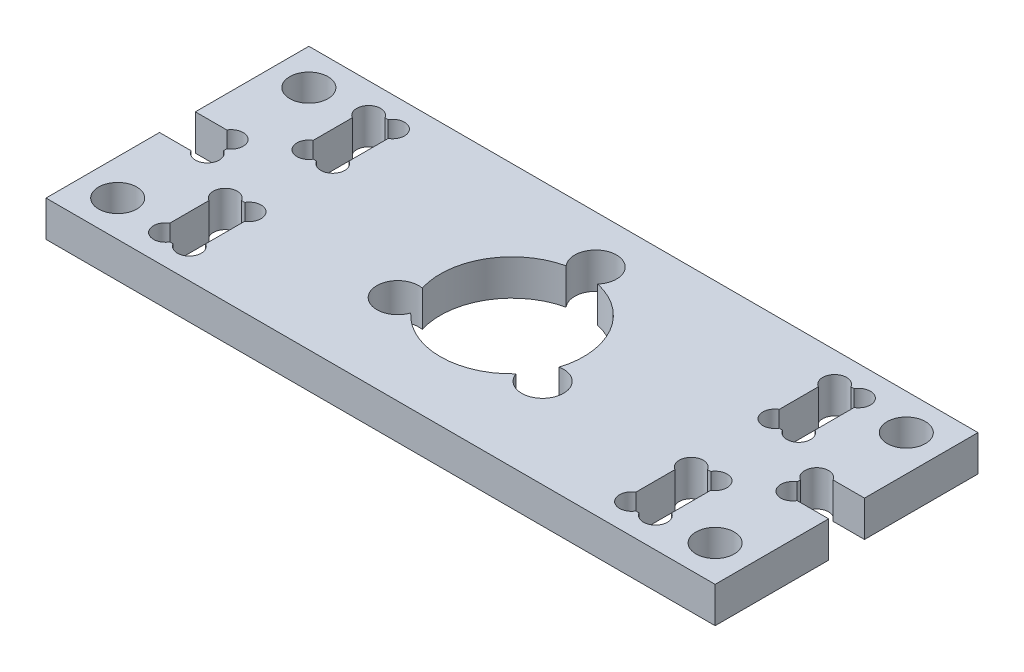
ISO-10303-21;
HEADER;
FILE_DESCRIPTION(('STEP AP214'),'2;1');
FILE_NAME('part.step','',(''),(''),'','','');
FILE_SCHEMA(('AUTOMOTIVE_DESIGN { 1 0 10303 214 1 1 1 1 }'));
ENDSEC;
DATA;
#1=APPLICATION_CONTEXT('core data for automotive mechanical design processes');
#2=APPLICATION_PROTOCOL_DEFINITION('international standard','automotive_design',2000,#1);
#3=PRODUCT_CONTEXT('',#1,'mechanical');
#4=PRODUCT('Part','Part','',(#3));
#5=PRODUCT_RELATED_PRODUCT_CATEGORY('part','',(#4));
#6=PRODUCT_DEFINITION_FORMATION('','',#4);
#7=PRODUCT_DEFINITION_CONTEXT('part definition',#1,'design');
#8=PRODUCT_DEFINITION('design','',#6,#7);
#9=PRODUCT_DEFINITION_SHAPE('','',#8);
#10=(LENGTH_UNIT() NAMED_UNIT(*) SI_UNIT(.MILLI.,.METRE.));
#11=(NAMED_UNIT(*) PLANE_ANGLE_UNIT() SI_UNIT($,.RADIAN.));
#12=(NAMED_UNIT(*) SI_UNIT($,.STERADIAN.) SOLID_ANGLE_UNIT());
#13=UNCERTAINTY_MEASURE_WITH_UNIT(LENGTH_MEASURE(1.E-05),#10,'distance_accuracy_value','');
#14=(GEOMETRIC_REPRESENTATION_CONTEXT(3) GLOBAL_UNCERTAINTY_ASSIGNED_CONTEXT((#13)) GLOBAL_UNIT_ASSIGNED_CONTEXT((#10,
#11,#12)) REPRESENTATION_CONTEXT('',''));
#15=CARTESIAN_POINT('',(0.,0.,0.));
#16=DIRECTION('',(0.,0.,1.));
#17=DIRECTION('',(1.,0.,0.));
#18=AXIS2_PLACEMENT_3D('',#15,#16,#17);
#19=CARTESIAN_POINT('',(0.,0.,0.));
#20=DIRECTION('',(0.,1.,0.));
#21=DIRECTION('',(0.,0.,1.));
#22=AXIS2_PLACEMENT_3D('',#19,#20,#21);
#23=CYLINDRICAL_SURFACE('',#22,6.);
#24=CARTESIAN_POINT('',(0.,0.,0.));
#25=DIRECTION('',(0.,1.,0.));
#26=DIRECTION('',(0.,0.,1.));
#27=AXIS2_PLACEMENT_3D('',#24,#25,#26);
#28=CIRCLE('',#27,6.);
#29=CARTESIAN_POINT('',(-1.32142103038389,0.,-5.85267857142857));
#30=VERTEX_POINT('',#29);
#31=CARTESIAN_POINT('',(-5.72927883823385,0.,1.78195510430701));
#32=VERTEX_POINT('',#31);
#33=EDGE_CURVE('E394',#30,#32,#28,.T.);
#34=ORIENTED_EDGE('',*,*,#33,.F.);
#35=DIRECTION('',(0.,1.,0.));
#36=VECTOR('',#35,1.);
#37=CARTESIAN_POINT('',(-1.32142103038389,1.5,-5.85267857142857));
#38=LINE('',#37,#36);
#39=CARTESIAN_POINT('',(-1.32142103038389,3.,-5.85267857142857));
#40=VERTEX_POINT('',#39);
#41=EDGE_CURVE('E376',#30,#40,#38,.T.);
#42=ORIENTED_EDGE('',*,*,#41,.T.);
#43=CARTESIAN_POINT('',(0.,3.,0.));
#44=DIRECTION('',(0.,1.,0.));
#45=DIRECTION('',(0.,0.,1.));
#46=AXIS2_PLACEMENT_3D('',#43,#44,#45);
#47=CIRCLE('',#46,6.);
#48=CARTESIAN_POINT('',(-5.72927883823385,3.,1.78195510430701));
#49=VERTEX_POINT('',#48);
#50=EDGE_CURVE('E404',#40,#49,#47,.T.);
#51=ORIENTED_EDGE('',*,*,#50,.T.);
#52=DIRECTION('',(0.,1.,0.));
#53=VECTOR('',#52,1.);
#54=CARTESIAN_POINT('',(-5.72927883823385,1.5,1.78195510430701));
#55=LINE('',#54,#53);
#56=EDGE_CURVE('E483',#49,#32,#55,.F.);
#57=ORIENTED_EDGE('',*,*,#56,.T.);
#58=EDGE_LOOP('',(#34,#42,#51,#57));
#59=FACE_BOUND('',#58,.T.);
#60=ADVANCED_FACE('F35',(#59),#23,.F.);
#61=CARTESIAN_POINT('',(5.72927883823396,3.,1.78195510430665));
#62=VERTEX_POINT('',#61);
#63=CARTESIAN_POINT('',(1.32142103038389,3.,-5.85267857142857));
#64=VERTEX_POINT('',#63);
#65=EDGE_CURVE('E388',#62,#64,#47,.T.);
#66=ORIENTED_EDGE('',*,*,#65,.T.);
#67=DIRECTION('',(0.,1.,0.));
#68=VECTOR('',#67,1.);
#69=CARTESIAN_POINT('',(1.32142103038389,1.5,-5.85267857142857));
#70=LINE('',#69,#68);
#71=CARTESIAN_POINT('',(1.32142103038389,0.,-5.85267857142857));
#72=VERTEX_POINT('',#71);
#73=EDGE_CURVE('E50',#64,#72,#70,.F.);
#74=ORIENTED_EDGE('',*,*,#73,.T.);
#75=CARTESIAN_POINT('',(5.72927883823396,0.,1.78195510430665));
#76=VERTEX_POINT('',#75);
#77=EDGE_CURVE('E386',#76,#72,#28,.T.);
#78=ORIENTED_EDGE('',*,*,#77,.F.);
#79=DIRECTION('',(0.,1.,0.));
#80=VECTOR('',#79,1.);
#81=CARTESIAN_POINT('',(5.72927883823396,1.5,1.78195510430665));
#82=LINE('',#81,#80);
#83=EDGE_CURVE('E57',#76,#62,#82,.T.);
#84=ORIENTED_EDGE('',*,*,#83,.T.);
#85=EDGE_LOOP('',(#66,#74,#78,#84));
#86=FACE_BOUND('',#85,.T.);
#87=ADVANCED_FACE('F385',(#86),#23,.F.);
#88=CARTESIAN_POINT('',(0.,3.,0.));
#89=DIRECTION('',(0.,-1.,0.));
#90=DIRECTION('',(0.,0.,-1.));
#91=AXIS2_PLACEMENT_3D('',#88,#89,#90);
#92=PLANE('',#91);
#93=CARTESIAN_POINT('',(-20.5,3.,-8.5));
#94=DIRECTION('',(0.,1.,0.));
#95=DIRECTION('',(0.,0.,1.));
#96=AXIS2_PLACEMENT_3D('',#93,#94,#95);
#97=CIRCLE('',#96,0.999999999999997);
#98=CARTESIAN_POINT('',(-19.6339745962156,3.,-9.));
#99=VERTEX_POINT('',#98);
#100=CARTESIAN_POINT('',(-21.,3.,-7.63397459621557));
#101=VERTEX_POINT('',#100);
#102=EDGE_CURVE('E489',#99,#101,#97,.T.);
#103=ORIENTED_EDGE('',*,*,#102,.F.);
#104=DIRECTION('',(-1.,0.,0.));
#105=VECTOR('',#104,1.);
#106=CARTESIAN_POINT('',(-21.,3.,-9.));
#107=LINE('',#106,#105);
#108=CARTESIAN_POINT('',(-19.3660254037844,3.,-9.));
#109=VERTEX_POINT('',#108);
#110=EDGE_CURVE('E400',#109,#99,#107,.T.);
#111=ORIENTED_EDGE('',*,*,#110,.F.);
#112=CARTESIAN_POINT('',(-18.5,3.,-8.5));
#113=DIRECTION('',(0.,1.,0.));
#114=DIRECTION('',(0.,0.,1.));
#115=AXIS2_PLACEMENT_3D('',#112,#113,#114);
#116=CIRCLE('',#115,0.999999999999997);
#117=CARTESIAN_POINT('',(-18.,3.,-7.63397459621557));
#118=VERTEX_POINT('',#117);
#119=EDGE_CURVE('E500',#118,#109,#116,.T.);
#120=ORIENTED_EDGE('',*,*,#119,.F.);
#121=DIRECTION('',(0.,0.,-1.));
#122=VECTOR('',#121,1.);
#123=CARTESIAN_POINT('',(-18.,3.,-9.));
#124=LINE('',#123,#122);
#125=CARTESIAN_POINT('',(-18.,3.,-4.36602540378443));
#126=VERTEX_POINT('',#125);
#127=EDGE_CURVE('E824',#126,#118,#124,.T.);
#128=ORIENTED_EDGE('',*,*,#127,.F.);
#129=CARTESIAN_POINT('',(-18.5,3.,-3.5));
#130=DIRECTION('',(0.,1.,0.));
#131=DIRECTION('',(0.,0.,1.));
#132=AXIS2_PLACEMENT_3D('',#129,#130,#131);
#133=CIRCLE('',#132,0.999999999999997);
#134=CARTESIAN_POINT('',(-19.3660254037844,3.,-3.));
#135=VERTEX_POINT('',#134);
#136=EDGE_CURVE('E511',#135,#126,#133,.T.);
#137=ORIENTED_EDGE('',*,*,#136,.F.);
#138=DIRECTION('',(1.,0.,0.));
#139=VECTOR('',#138,1.);
#140=CARTESIAN_POINT('',(-21.,3.,-3.));
#141=LINE('',#140,#139);
#142=CARTESIAN_POINT('',(-19.6339745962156,3.,-3.));
#143=VERTEX_POINT('',#142);
#144=EDGE_CURVE('E822',#143,#135,#141,.T.);
#145=ORIENTED_EDGE('',*,*,#144,.F.);
#146=CARTESIAN_POINT('',(-20.5,3.,-3.5));
#147=DIRECTION('',(0.,1.,0.));
#148=DIRECTION('',(0.,0.,1.));
#149=AXIS2_PLACEMENT_3D('',#146,#147,#148);
#150=CIRCLE('',#149,0.999999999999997);
#151=CARTESIAN_POINT('',(-21.,3.,-4.36602540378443));
#152=VERTEX_POINT('',#151);
#153=EDGE_CURVE('E519',#152,#143,#150,.T.);
#154=ORIENTED_EDGE('',*,*,#153,.F.);
#155=DIRECTION('',(0.,0.,1.));
#156=VECTOR('',#155,1.);
#157=CARTESIAN_POINT('',(-21.,3.,-9.));
#158=LINE('',#157,#156);
#159=EDGE_CURVE('E714',#101,#152,#158,.T.);
#160=ORIENTED_EDGE('',*,*,#159,.F.);
#161=EDGE_LOOP('',(#103,#111,#120,#128,#137,#145,#154,#160));
#162=FACE_BOUND('',#161,.T.);
#163=CARTESIAN_POINT('',(-25.,3.,-8.));
#164=DIRECTION('',(0.,1.,0.));
#165=DIRECTION('',(0.,0.,1.));
#166=AXIS2_PLACEMENT_3D('',#163,#164,#165);
#167=CIRCLE('',#166,1.59999999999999);
#168=CARTESIAN_POINT('',(-25.,3.,-6.40000000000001));
#169=VERTEX_POINT('',#168);
#170=EDGE_CURVE('E396',#169,#169,#167,.T.);
#171=ORIENTED_EDGE('',*,*,#170,.F.);
#172=EDGE_LOOP('',(#171));
#173=FACE_BOUND('',#172,.T.);
#174=CARTESIAN_POINT('',(25.,3.,-8.00000000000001));
#175=DIRECTION('',(0.,1.,0.));
#176=DIRECTION('',(0.,0.,1.));
#177=AXIS2_PLACEMENT_3D('',#174,#175,#176);
#178=CIRCLE('',#177,1.59999999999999);
#179=CARTESIAN_POINT('',(25.,3.,-6.40000000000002));
#180=VERTEX_POINT('',#179);
#181=EDGE_CURVE('E410',#180,#180,#178,.T.);
#182=ORIENTED_EDGE('',*,*,#181,.F.);
#183=EDGE_LOOP('',(#182));
#184=FACE_BOUND('',#183,.T.);
#185=CARTESIAN_POINT('',(25.,3.,8.00000000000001));
#186=DIRECTION('',(0.,1.,0.));
#187=DIRECTION('',(0.,0.,1.));
#188=AXIS2_PLACEMENT_3D('',#185,#186,#187);
#189=CIRCLE('',#188,1.59999999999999);
#190=CARTESIAN_POINT('',(25.,3.,9.59999999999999));
#191=VERTEX_POINT('',#190);
#192=EDGE_CURVE('E416',#191,#191,#189,.T.);
#193=ORIENTED_EDGE('',*,*,#192,.F.);
#194=EDGE_LOOP('',(#193));
#195=FACE_BOUND('',#194,.T.);
#196=CARTESIAN_POINT('',(-25.,3.,8.00000000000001));
#197=DIRECTION('',(0.,1.,0.));
#198=DIRECTION('',(0.,0.,1.));
#199=AXIS2_PLACEMENT_3D('',#196,#197,#198);
#200=CIRCLE('',#199,1.59999999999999);
#201=CARTESIAN_POINT('',(-25.,3.,9.6));
#202=VERTEX_POINT('',#201);
#203=EDGE_CURVE('E422',#202,#202,#200,.T.);
#204=ORIENTED_EDGE('',*,*,#203,.F.);
#205=EDGE_LOOP('',(#204));
#206=FACE_BOUND('',#205,.T.);
#207=CARTESIAN_POINT('',(20.5,3.,-3.49999999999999));
#208=DIRECTION('',(0.,1.,0.));
#209=DIRECTION('',(0.,0.,1.));
#210=AXIS2_PLACEMENT_3D('',#207,#208,#209);
#211=CIRCLE('',#210,0.999999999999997);
#212=CARTESIAN_POINT('',(19.6339745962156,3.,-3.00000000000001));
#213=VERTEX_POINT('',#212);
#214=CARTESIAN_POINT('',(21.,3.,-4.36602540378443));
#215=VERTEX_POINT('',#214);
#216=EDGE_CURVE('E662',#213,#215,#211,.T.);
#217=ORIENTED_EDGE('',*,*,#216,.F.);
#218=DIRECTION('',(1.,0.,0.));
#219=VECTOR('',#218,1.);
#220=CARTESIAN_POINT('',(21.,3.,-3.00000000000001));
#221=LINE('',#220,#219);
#222=CARTESIAN_POINT('',(19.3660254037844,3.,-3.00000000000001));
#223=VERTEX_POINT('',#222);
#224=EDGE_CURVE('E766',#223,#213,#221,.T.);
#225=ORIENTED_EDGE('',*,*,#224,.F.);
#226=CARTESIAN_POINT('',(18.5,3.,-3.49999999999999));
#227=DIRECTION('',(0.,1.,0.));
#228=DIRECTION('',(0.,0.,1.));
#229=AXIS2_PLACEMENT_3D('',#226,#227,#228);
#230=CIRCLE('',#229,0.999999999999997);
#231=CARTESIAN_POINT('',(18.,3.,-4.36602540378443));
#232=VERTEX_POINT('',#231);
#233=EDGE_CURVE('E667',#232,#223,#230,.T.);
#234=ORIENTED_EDGE('',*,*,#233,.F.);
#235=DIRECTION('',(0.,0.,1.));
#236=VECTOR('',#235,1.);
#237=CARTESIAN_POINT('',(18.,3.,-9.00000000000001));
#238=LINE('',#237,#236);
#239=CARTESIAN_POINT('',(18.,3.,-7.63397459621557));
#240=VERTEX_POINT('',#239);
#241=EDGE_CURVE('E762',#240,#232,#238,.T.);
#242=ORIENTED_EDGE('',*,*,#241,.F.);
#243=CARTESIAN_POINT('',(18.5,3.,-8.50000000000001));
#244=DIRECTION('',(0.,1.,0.));
#245=DIRECTION('',(0.,0.,1.));
#246=AXIS2_PLACEMENT_3D('',#243,#244,#245);
#247=CIRCLE('',#246,0.999999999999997);
#248=CARTESIAN_POINT('',(19.3660254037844,3.,-9.00000000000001));
#249=VERTEX_POINT('',#248);
#250=EDGE_CURVE('E682',#249,#240,#247,.T.);
#251=ORIENTED_EDGE('',*,*,#250,.F.);
#252=DIRECTION('',(-1.,0.,0.));
#253=VECTOR('',#252,1.);
#254=CARTESIAN_POINT('',(21.,3.,-9.00000000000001));
#255=LINE('',#254,#253);
#256=CARTESIAN_POINT('',(19.6339745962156,3.,-9.00000000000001));
#257=VERTEX_POINT('',#256);
#258=EDGE_CURVE('E759',#257,#249,#255,.T.);
#259=ORIENTED_EDGE('',*,*,#258,.F.);
#260=CARTESIAN_POINT('',(20.5,3.,-8.50000000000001));
#261=DIRECTION('',(0.,1.,0.));
#262=DIRECTION('',(0.,0.,1.));
#263=AXIS2_PLACEMENT_3D('',#260,#261,#262);
#264=CIRCLE('',#263,0.999999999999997);
#265=CARTESIAN_POINT('',(21.,3.,-7.63397459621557));
#266=VERTEX_POINT('',#265);
#267=EDGE_CURVE('E693',#266,#257,#264,.T.);
#268=ORIENTED_EDGE('',*,*,#267,.F.);
#269=DIRECTION('',(0.,0.,-1.));
#270=VECTOR('',#269,1.);
#271=CARTESIAN_POINT('',(21.,3.,-9.00000000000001));
#272=LINE('',#271,#270);
#273=EDGE_CURVE('E752',#215,#266,#272,.T.);
#274=ORIENTED_EDGE('',*,*,#273,.F.);
#275=EDGE_LOOP('',(#217,#225,#234,#242,#251,#259,#268,#274));
#276=FACE_BOUND('',#275,.T.);
#277=CARTESIAN_POINT('',(20.5,3.,8.50000000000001));
#278=DIRECTION('',(0.,1.,0.));
#279=DIRECTION('',(0.,0.,1.));
#280=AXIS2_PLACEMENT_3D('',#277,#278,#279);
#281=CIRCLE('',#280,0.999999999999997);
#282=CARTESIAN_POINT('',(19.6339745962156,3.,9.00000000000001));
#283=VERTEX_POINT('',#282);
#284=CARTESIAN_POINT('',(21.,3.,7.63397459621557));
#285=VERTEX_POINT('',#284);
#286=EDGE_CURVE('E618',#283,#285,#281,.T.);
#287=ORIENTED_EDGE('',*,*,#286,.F.);
#288=DIRECTION('',(1.,0.,0.));
#289=VECTOR('',#288,1.);
#290=CARTESIAN_POINT('',(21.,3.,9.00000000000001));
#291=LINE('',#290,#289);
#292=CARTESIAN_POINT('',(19.3660254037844,3.,9.00000000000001));
#293=VERTEX_POINT('',#292);
#294=EDGE_CURVE('E729',#293,#283,#291,.T.);
#295=ORIENTED_EDGE('',*,*,#294,.F.);
#296=CARTESIAN_POINT('',(18.5,3.,8.50000000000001));
#297=DIRECTION('',(0.,1.,0.));
#298=DIRECTION('',(0.,0.,1.));
#299=AXIS2_PLACEMENT_3D('',#296,#297,#298);
#300=CIRCLE('',#299,0.999999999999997);
#301=CARTESIAN_POINT('',(18.,3.,7.63397459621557));
#302=VERTEX_POINT('',#301);
#303=EDGE_CURVE('E629',#302,#293,#300,.T.);
#304=ORIENTED_EDGE('',*,*,#303,.F.);
#305=DIRECTION('',(0.,0.,1.));
#306=VECTOR('',#305,1.);
#307=CARTESIAN_POINT('',(18.,3.,9.00000000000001));
#308=LINE('',#307,#306);
#309=CARTESIAN_POINT('',(18.,3.,4.36602540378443));
#310=VERTEX_POINT('',#309);
#311=EDGE_CURVE('E743',#310,#302,#308,.T.);
#312=ORIENTED_EDGE('',*,*,#311,.F.);
#313=CARTESIAN_POINT('',(18.5,3.,3.49999999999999));
#314=DIRECTION('',(0.,1.,0.));
#315=DIRECTION('',(0.,0.,1.));
#316=AXIS2_PLACEMENT_3D('',#313,#314,#315);
#317=CIRCLE('',#316,0.999999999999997);
#318=CARTESIAN_POINT('',(19.3660254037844,3.,3.00000000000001));
#319=VERTEX_POINT('',#318);
#320=EDGE_CURVE('E640',#319,#310,#317,.T.);
#321=ORIENTED_EDGE('',*,*,#320,.F.);
#322=DIRECTION('',(-1.,0.,0.));
#323=VECTOR('',#322,1.);
#324=CARTESIAN_POINT('',(21.,3.,3.00000000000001));
#325=LINE('',#324,#323);
#326=CARTESIAN_POINT('',(19.6339745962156,3.,3.00000000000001));
#327=VERTEX_POINT('',#326);
#328=EDGE_CURVE('E739',#327,#319,#325,.T.);
#329=ORIENTED_EDGE('',*,*,#328,.F.);
#330=CARTESIAN_POINT('',(20.5,3.,3.49999999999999));
#331=DIRECTION('',(0.,1.,0.));
#332=DIRECTION('',(0.,0.,1.));
#333=AXIS2_PLACEMENT_3D('',#330,#331,#332);
#334=CIRCLE('',#333,0.999999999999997);
#335=CARTESIAN_POINT('',(21.,3.,4.36602540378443));
#336=VERTEX_POINT('',#335);
#337=EDGE_CURVE('E651',#336,#327,#334,.T.);
#338=ORIENTED_EDGE('',*,*,#337,.F.);
#339=DIRECTION('',(0.,0.,-1.));
#340=VECTOR('',#339,1.);
#341=CARTESIAN_POINT('',(21.,3.,9.00000000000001));
#342=LINE('',#341,#340);
#343=EDGE_CURVE('E737',#285,#336,#342,.T.);
#344=ORIENTED_EDGE('',*,*,#343,.F.);
#345=EDGE_LOOP('',(#287,#295,#304,#312,#321,#329,#338,#344));
#346=FACE_BOUND('',#345,.T.);
#347=CARTESIAN_POINT('',(-20.5,3.,3.5));
#348=DIRECTION('',(0.,1.,0.));
#349=DIRECTION('',(0.,0.,1.));
#350=AXIS2_PLACEMENT_3D('',#347,#348,#349);
#351=CIRCLE('',#350,0.999999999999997);
#352=CARTESIAN_POINT('',(-19.6339745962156,3.,3.));
#353=VERTEX_POINT('',#352);
#354=CARTESIAN_POINT('',(-21.,3.,4.36602540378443));
#355=VERTEX_POINT('',#354);
#356=EDGE_CURVE('E552',#353,#355,#351,.T.);
#357=ORIENTED_EDGE('',*,*,#356,.F.);
#358=DIRECTION('',(-1.,0.,0.));
#359=VECTOR('',#358,1.);
#360=CARTESIAN_POINT('',(-21.,3.,3.));
#361=LINE('',#360,#359);
#362=CARTESIAN_POINT('',(-19.3660254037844,3.,3.));
#363=VERTEX_POINT('',#362);
#364=EDGE_CURVE('E722',#363,#353,#361,.T.);
#365=ORIENTED_EDGE('',*,*,#364,.F.);
#366=CARTESIAN_POINT('',(-18.5,3.,3.5));
#367=DIRECTION('',(0.,1.,0.));
#368=DIRECTION('',(0.,0.,1.));
#369=AXIS2_PLACEMENT_3D('',#366,#367,#368);
#370=CIRCLE('',#369,0.999999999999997);
#371=CARTESIAN_POINT('',(-18.,3.,4.36602540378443));
#372=VERTEX_POINT('',#371);
#373=EDGE_CURVE('E563',#372,#363,#370,.T.);
#374=ORIENTED_EDGE('',*,*,#373,.F.);
#375=DIRECTION('',(0.,0.,-1.));
#376=VECTOR('',#375,1.);
#377=CARTESIAN_POINT('',(-18.,3.,9.));
#378=LINE('',#377,#376);
#379=CARTESIAN_POINT('',(-18.,3.,7.63397459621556));
#380=VERTEX_POINT('',#379);
#381=EDGE_CURVE('E718',#380,#372,#378,.T.);
#382=ORIENTED_EDGE('',*,*,#381,.F.);
#383=CARTESIAN_POINT('',(-18.5,3.,8.5));
#384=DIRECTION('',(0.,1.,0.));
#385=DIRECTION('',(0.,0.,1.));
#386=AXIS2_PLACEMENT_3D('',#383,#384,#385);
#387=CIRCLE('',#386,0.999999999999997);
#388=CARTESIAN_POINT('',(-19.3660254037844,3.,9.));
#389=VERTEX_POINT('',#388);
#390=EDGE_CURVE('E546',#389,#380,#387,.T.);
#391=ORIENTED_EDGE('',*,*,#390,.F.);
#392=DIRECTION('',(1.,0.,0.));
#393=VECTOR('',#392,1.);
#394=CARTESIAN_POINT('',(-21.,3.,9.));
#395=LINE('',#394,#393);
#396=CARTESIAN_POINT('',(-19.6339745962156,3.,9.));
#397=VERTEX_POINT('',#396);
#398=EDGE_CURVE('E715',#397,#389,#395,.T.);
#399=ORIENTED_EDGE('',*,*,#398,.F.);
#400=CARTESIAN_POINT('',(-20.5,3.,8.5));
#401=DIRECTION('',(0.,1.,0.));
#402=DIRECTION('',(0.,0.,1.));
#403=AXIS2_PLACEMENT_3D('',#400,#401,#402);
#404=CIRCLE('',#403,0.999999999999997);
#405=CARTESIAN_POINT('',(-21.,3.,7.63397459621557));
#406=VERTEX_POINT('',#405);
#407=EDGE_CURVE('E585',#406,#397,#404,.T.);
#408=ORIENTED_EDGE('',*,*,#407,.F.);
#409=DIRECTION('',(0.,0.,1.));
#410=VECTOR('',#409,1.);
#411=CARTESIAN_POINT('',(-21.,3.,9.));
#412=LINE('',#411,#410);
#413=EDGE_CURVE('E706',#355,#406,#412,.T.);
#414=ORIENTED_EDGE('',*,*,#413,.F.);
#415=EDGE_LOOP('',(#357,#365,#374,#382,#391,#399,#408,#414));
#416=FACE_BOUND('',#415,.T.);
#417=CARTESIAN_POINT('',(-24.5,3.,-1.));
#418=DIRECTION('',(0.,1.,0.));
#419=DIRECTION('',(0.,0.,1.));
#420=AXIS2_PLACEMENT_3D('',#417,#418,#419);
#421=CIRCLE('',#420,0.999999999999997);
#422=CARTESIAN_POINT('',(-24.,3.,-0.133974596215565));
#423=VERTEX_POINT('',#422);
#424=CARTESIAN_POINT('',(-25.3660254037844,3.,-1.5));
#425=VERTEX_POINT('',#424);
#426=EDGE_CURVE('E530',#423,#425,#421,.T.);
#427=ORIENTED_EDGE('',*,*,#426,.F.);
#428=DIRECTION('',(0.,0.,-1.));
#429=VECTOR('',#428,1.);
#430=CARTESIAN_POINT('',(-24.,3.,-1.5));
#431=LINE('',#430,#429);
#432=CARTESIAN_POINT('',(-24.,3.,0.133974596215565));
#433=VERTEX_POINT('',#432);
#434=EDGE_CURVE('E783',#433,#423,#431,.T.);
#435=ORIENTED_EDGE('',*,*,#434,.F.);
#436=CARTESIAN_POINT('',(-24.5,3.,1.));
#437=DIRECTION('',(0.,1.,0.));
#438=DIRECTION('',(0.,0.,1.));
#439=AXIS2_PLACEMENT_3D('',#436,#437,#438);
#440=CIRCLE('',#439,0.999999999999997);
#441=CARTESIAN_POINT('',(-25.3660254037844,3.,1.5));
#442=VERTEX_POINT('',#441);
#443=EDGE_CURVE('E541',#442,#433,#440,.T.);
#444=ORIENTED_EDGE('',*,*,#443,.F.);
#445=DIRECTION('',(1.,0.,0.));
#446=VECTOR('',#445,1.);
#447=CARTESIAN_POINT('',(-28.,3.,1.5));
#448=LINE('',#447,#446);
#449=CARTESIAN_POINT('',(-28.,3.,1.5));
#450=VERTEX_POINT('',#449);
#451=EDGE_CURVE('E780',#450,#442,#448,.T.);
#452=ORIENTED_EDGE('',*,*,#451,.F.);
#453=DIRECTION('',(0.,0.,1.));
#454=VECTOR('',#453,1.);
#455=CARTESIAN_POINT('',(-28.,3.,11.));
#456=LINE('',#455,#454);
#457=CARTESIAN_POINT('',(-28.,3.,11.));
#458=VERTEX_POINT('',#457);
#459=EDGE_CURVE('E435',#450,#458,#456,.T.);
#460=ORIENTED_EDGE('',*,*,#459,.T.);
#461=DIRECTION('',(1.,0.,0.));
#462=VECTOR('',#461,1.);
#463=CARTESIAN_POINT('',(-28.,3.,11.));
#464=LINE('',#463,#462);
#465=CARTESIAN_POINT('',(28.,3.,11.));
#466=VERTEX_POINT('',#465);
#467=EDGE_CURVE('E439',#458,#466,#464,.T.);
#468=ORIENTED_EDGE('',*,*,#467,.T.);
#469=DIRECTION('',(0.,0.,-1.));
#470=VECTOR('',#469,1.);
#471=CARTESIAN_POINT('',(28.,3.,11.));
#472=LINE('',#471,#470);
#473=CARTESIAN_POINT('',(28.,3.,1.50000000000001));
#474=VERTEX_POINT('',#473);
#475=EDGE_CURVE('E429',#466,#474,#472,.T.);
#476=ORIENTED_EDGE('',*,*,#475,.T.);
#477=DIRECTION('',(1.,0.,0.));
#478=VECTOR('',#477,1.);
#479=CARTESIAN_POINT('',(28.,3.,1.50000000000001));
#480=LINE('',#479,#478);
#481=CARTESIAN_POINT('',(25.3660254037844,3.,1.5));
#482=VERTEX_POINT('',#481);
#483=EDGE_CURVE('E795',#482,#474,#480,.T.);
#484=ORIENTED_EDGE('',*,*,#483,.F.);
#485=CARTESIAN_POINT('',(24.5,3.,1.00000000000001));
#486=DIRECTION('',(0.,1.,0.));
#487=DIRECTION('',(0.,0.,1.));
#488=AXIS2_PLACEMENT_3D('',#485,#486,#487);
#489=CIRCLE('',#488,0.999999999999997);
#490=CARTESIAN_POINT('',(24.,3.,0.133974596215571));
#491=VERTEX_POINT('',#490);
#492=EDGE_CURVE('E596',#491,#482,#489,.T.);
#493=ORIENTED_EDGE('',*,*,#492,.F.);
#494=DIRECTION('',(0.,0.,1.));
#495=VECTOR('',#494,1.);
#496=CARTESIAN_POINT('',(24.,3.,-1.49999999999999));
#497=LINE('',#496,#495);
#498=CARTESIAN_POINT('',(24.,3.,-0.133974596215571));
#499=VERTEX_POINT('',#498);
#500=EDGE_CURVE('E803',#499,#491,#497,.T.);
#501=ORIENTED_EDGE('',*,*,#500,.F.);
#502=CARTESIAN_POINT('',(24.5,3.,-1.00000000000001));
#503=DIRECTION('',(0.,1.,0.));
#504=DIRECTION('',(0.,0.,1.));
#505=AXIS2_PLACEMENT_3D('',#502,#503,#504);
#506=CIRCLE('',#505,0.999999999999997);
#507=CARTESIAN_POINT('',(25.3660254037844,3.,-1.5));
#508=VERTEX_POINT('',#507);
#509=EDGE_CURVE('E607',#508,#499,#506,.T.);
#510=ORIENTED_EDGE('',*,*,#509,.F.);
#511=DIRECTION('',(-1.,0.,0.));
#512=VECTOR('',#511,1.);
#513=CARTESIAN_POINT('',(28.,3.,-1.50000000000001));
#514=LINE('',#513,#512);
#515=CARTESIAN_POINT('',(28.,3.,-1.50000000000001));
#516=VERTEX_POINT('',#515);
#517=EDGE_CURVE('E701',#516,#508,#514,.T.);
#518=ORIENTED_EDGE('',*,*,#517,.F.);
#519=CARTESIAN_POINT('',(28.,3.,-11.));
#520=VERTEX_POINT('',#519);
#521=EDGE_CURVE('E433',#516,#520,#472,.T.);
#522=ORIENTED_EDGE('',*,*,#521,.T.);
#523=DIRECTION('',(-1.,0.,0.));
#524=VECTOR('',#523,1.);
#525=CARTESIAN_POINT('',(-28.,3.,-11.));
#526=LINE('',#525,#524);
#527=CARTESIAN_POINT('',(-28.,3.,-11.));
#528=VERTEX_POINT('',#527);
#529=EDGE_CURVE('E432',#520,#528,#526,.T.);
#530=ORIENTED_EDGE('',*,*,#529,.T.);
#531=CARTESIAN_POINT('',(-28.,3.,-1.5));
#532=VERTEX_POINT('',#531);
#533=EDGE_CURVE('E436',#528,#532,#456,.T.);
#534=ORIENTED_EDGE('',*,*,#533,.T.);
#535=DIRECTION('',(-1.,0.,0.));
#536=VECTOR('',#535,1.);
#537=CARTESIAN_POINT('',(-28.,3.,-1.5));
#538=LINE('',#537,#536);
#539=EDGE_CURVE('E774',#425,#532,#538,.T.);
#540=ORIENTED_EDGE('',*,*,#539,.F.);
#541=EDGE_LOOP('',(#427,#435,#444,#452,#460,#468,#476,#484,#493,#501,#510,#518,#522,#530,#534,#540));
#542=FACE_BOUND('',#541,.T.);
#543=ORIENTED_EDGE('',*,*,#50,.F.);
#544=CARTESIAN_POINT('',(0.,3.,-7.));
#545=DIRECTION('',(0.,1.,0.));
#546=DIRECTION('',(0.,0.,1.));
#547=AXIS2_PLACEMENT_3D('',#544,#545,#546);
#548=CIRCLE('',#547,1.75);
#549=EDGE_CURVE('E380',#64,#40,#548,.T.);
#550=ORIENTED_EDGE('',*,*,#549,.F.);
#551=ORIENTED_EDGE('',*,*,#65,.F.);
#552=CARTESIAN_POINT('',(6.06217782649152,3.,3.49999999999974));
#553=DIRECTION('',(0.,1.,0.));
#554=DIRECTION('',(0.,0.,1.));
#555=AXIS2_PLACEMENT_3D('',#552,#553,#554);
#556=CIRCLE('',#555,1.75);
#557=CARTESIAN_POINT('',(4.40785780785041,3.,4.07072346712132));
#558=VERTEX_POINT('',#557);
#559=EDGE_CURVE('E891',#558,#62,#556,.T.);
#560=ORIENTED_EDGE('',*,*,#559,.F.);
#561=CARTESIAN_POINT('',(-4.40785780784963,3.,4.07072346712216));
#562=VERTEX_POINT('',#561);
#563=EDGE_CURVE('E397',#562,#558,#47,.T.);
#564=ORIENTED_EDGE('',*,*,#563,.F.);
#565=CARTESIAN_POINT('',(-6.06217782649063,3.,3.50000000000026));
#566=DIRECTION('',(0.,-1.,0.));
#567=DIRECTION('',(0.,0.,-1.));
#568=AXIS2_PLACEMENT_3D('',#565,#566,#567);
#569=CIRCLE('',#568,1.75);
#570=EDGE_CURVE('E43',#562,#49,#569,.T.);
#571=ORIENTED_EDGE('',*,*,#570,.T.);
#572=EDGE_LOOP('',(#543,#550,#551,#560,#564,#571));
#573=FACE_BOUND('',#572,.T.);
#574=ADVANCED_FACE('F836',(#162,#173,#184,#195,#206,#276,#346,#416,#542,#573),#92,.F.);
#575=CARTESIAN_POINT('',(0.,0.,0.));
#576=DIRECTION('',(0.,-1.,0.));
#577=DIRECTION('',(0.,0.,-1.));
#578=AXIS2_PLACEMENT_3D('',#575,#576,#577);
#579=PLANE('',#578);
#580=CARTESIAN_POINT('',(0.,0.,-7.));
#581=DIRECTION('',(0.,1.,0.));
#582=DIRECTION('',(0.,0.,1.));
#583=AXIS2_PLACEMENT_3D('',#580,#581,#582);
#584=CIRCLE('',#583,1.75);
#585=EDGE_CURVE('E373',#72,#30,#584,.T.);
#586=ORIENTED_EDGE('',*,*,#585,.T.);
#587=ORIENTED_EDGE('',*,*,#33,.T.);
#588=CARTESIAN_POINT('',(-6.06217782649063,0.,3.50000000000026));
#589=DIRECTION('',(0.,1.,0.));
#590=DIRECTION('',(0.,0.,1.));
#591=AXIS2_PLACEMENT_3D('',#588,#589,#590);
#592=CIRCLE('',#591,1.75);
#593=CARTESIAN_POINT('',(-4.40785780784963,0.,4.07072346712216));
#594=VERTEX_POINT('',#593);
#595=EDGE_CURVE('E468',#32,#594,#592,.T.);
#596=ORIENTED_EDGE('',*,*,#595,.T.);
#597=CARTESIAN_POINT('',(4.40785780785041,0.,4.07072346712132));
#598=VERTEX_POINT('',#597);
#599=EDGE_CURVE('E393',#594,#598,#28,.T.);
#600=ORIENTED_EDGE('',*,*,#599,.T.);
#601=CARTESIAN_POINT('',(6.06217782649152,0.,3.49999999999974));
#602=DIRECTION('',(0.,-1.,0.));
#603=DIRECTION('',(0.,0.,-1.));
#604=AXIS2_PLACEMENT_3D('',#601,#602,#603);
#605=CIRCLE('',#604,1.75);
#606=EDGE_CURVE('E11',#76,#598,#605,.T.);
#607=ORIENTED_EDGE('',*,*,#606,.F.);
#608=ORIENTED_EDGE('',*,*,#77,.T.);
#609=EDGE_LOOP('',(#586,#587,#596,#600,#607,#608));
#610=FACE_BOUND('',#609,.T.);
#611=CARTESIAN_POINT('',(-20.5,0.,-8.5));
#612=DIRECTION('',(0.,1.,0.));
#613=DIRECTION('',(0.,0.,1.));
#614=AXIS2_PLACEMENT_3D('',#611,#612,#613);
#615=CIRCLE('',#614,1.);
#616=CARTESIAN_POINT('',(-19.6339745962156,0.,-9.));
#617=VERTEX_POINT('',#616);
#618=CARTESIAN_POINT('',(-21.,0.,-7.63397459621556));
#619=VERTEX_POINT('',#618);
#620=EDGE_CURVE('E491',#617,#619,#615,.T.);
#621=ORIENTED_EDGE('',*,*,#620,.T.);
#622=DIRECTION('',(0.,0.,1.));
#623=VECTOR('',#622,1.);
#624=CARTESIAN_POINT('',(-21.,0.,-9.));
#625=LINE('',#624,#623);
#626=CARTESIAN_POINT('',(-21.,0.,-4.36602540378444));
#627=VERTEX_POINT('',#626);
#628=EDGE_CURVE('E810',#619,#627,#625,.T.);
#629=ORIENTED_EDGE('',*,*,#628,.T.);
#630=CARTESIAN_POINT('',(-20.5,0.,-3.5));
#631=DIRECTION('',(0.,1.,0.));
#632=DIRECTION('',(0.,0.,1.));
#633=AXIS2_PLACEMENT_3D('',#630,#631,#632);
#634=CIRCLE('',#633,1.);
#635=CARTESIAN_POINT('',(-19.6339745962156,0.,-3.));
#636=VERTEX_POINT('',#635);
#637=EDGE_CURVE('E478',#627,#636,#634,.T.);
#638=ORIENTED_EDGE('',*,*,#637,.T.);
#639=DIRECTION('',(1.,0.,0.));
#640=VECTOR('',#639,1.);
#641=CARTESIAN_POINT('',(-21.,0.,-3.));
#642=LINE('',#641,#640);
#643=CARTESIAN_POINT('',(-19.3660254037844,0.,-3.));
#644=VERTEX_POINT('',#643);
#645=EDGE_CURVE('E812',#636,#644,#642,.T.);
#646=ORIENTED_EDGE('',*,*,#645,.T.);
#647=CARTESIAN_POINT('',(-18.5,0.,-3.5));
#648=DIRECTION('',(0.,1.,0.));
#649=DIRECTION('',(0.,0.,1.));
#650=AXIS2_PLACEMENT_3D('',#647,#648,#649);
#651=CIRCLE('',#650,1.);
#652=CARTESIAN_POINT('',(-18.,0.,-4.36602540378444));
#653=VERTEX_POINT('',#652);
#654=EDGE_CURVE('E473',#644,#653,#651,.T.);
#655=ORIENTED_EDGE('',*,*,#654,.T.);
#656=DIRECTION('',(0.,0.,-1.));
#657=VECTOR('',#656,1.);
#658=CARTESIAN_POINT('',(-18.,0.,-9.));
#659=LINE('',#658,#657);
#660=CARTESIAN_POINT('',(-18.,0.,-7.63397459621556));
#661=VERTEX_POINT('',#660);
#662=EDGE_CURVE('E815',#653,#661,#659,.T.);
#663=ORIENTED_EDGE('',*,*,#662,.T.);
#664=CARTESIAN_POINT('',(-18.5,0.,-8.5));
#665=DIRECTION('',(0.,1.,0.));
#666=DIRECTION('',(0.,0.,1.));
#667=AXIS2_PLACEMENT_3D('',#664,#665,#666);
#668=CIRCLE('',#667,1.);
#669=CARTESIAN_POINT('',(-19.3660254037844,0.,-9.));
#670=VERTEX_POINT('',#669);
#671=EDGE_CURVE('E502',#661,#670,#668,.T.);
#672=ORIENTED_EDGE('',*,*,#671,.T.);
#673=DIRECTION('',(-1.,0.,0.));
#674=VECTOR('',#673,1.);
#675=CARTESIAN_POINT('',(-21.,0.,-9.));
#676=LINE('',#675,#674);
#677=EDGE_CURVE('E818',#670,#617,#676,.T.);
#678=ORIENTED_EDGE('',*,*,#677,.T.);
#679=EDGE_LOOP('',(#621,#629,#638,#646,#655,#663,#672,#678));
#680=FACE_BOUND('',#679,.T.);
#681=CARTESIAN_POINT('',(-24.5,0.,-1.));
#682=DIRECTION('',(0.,1.,0.));
#683=DIRECTION('',(0.,0.,1.));
#684=AXIS2_PLACEMENT_3D('',#681,#682,#683);
#685=CIRCLE('',#684,1.);
#686=CARTESIAN_POINT('',(-24.,0.,-0.133974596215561));
#687=VERTEX_POINT('',#686);
#688=CARTESIAN_POINT('',(-25.3660254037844,0.,-1.5));
#689=VERTEX_POINT('',#688);
#690=EDGE_CURVE('E532',#687,#689,#685,.T.);
#691=ORIENTED_EDGE('',*,*,#690,.T.);
#692=DIRECTION('',(-1.,0.,0.));
#693=VECTOR('',#692,1.);
#694=CARTESIAN_POINT('',(-28.,0.,-1.5));
#695=LINE('',#694,#693);
#696=CARTESIAN_POINT('',(-28.,0.,-1.5));
#697=VERTEX_POINT('',#696);
#698=EDGE_CURVE('E777',#689,#697,#695,.T.);
#699=ORIENTED_EDGE('',*,*,#698,.T.);
#700=DIRECTION('',(0.,0.,1.));
#701=VECTOR('',#700,1.);
#702=CARTESIAN_POINT('',(-28.,0.,11.));
#703=LINE('',#702,#701);
#704=CARTESIAN_POINT('',(-28.,0.,-11.));
#705=VERTEX_POINT('',#704);
#706=EDGE_CURVE('E448',#705,#697,#703,.T.);
#707=ORIENTED_EDGE('',*,*,#706,.F.);
#708=DIRECTION('',(-1.,0.,0.));
#709=VECTOR('',#708,1.);
#710=CARTESIAN_POINT('',(-28.,0.,-11.));
#711=LINE('',#710,#709);
#712=CARTESIAN_POINT('',(28.,0.,-11.));
#713=VERTEX_POINT('',#712);
#714=EDGE_CURVE('E445',#713,#705,#711,.T.);
#715=ORIENTED_EDGE('',*,*,#714,.F.);
#716=DIRECTION('',(0.,0.,-1.));
#717=VECTOR('',#716,1.);
#718=CARTESIAN_POINT('',(28.,0.,11.));
#719=LINE('',#718,#717);
#720=CARTESIAN_POINT('',(28.,0.,-1.50000000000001));
#721=VERTEX_POINT('',#720);
#722=EDGE_CURVE('E428',#721,#713,#719,.T.);
#723=ORIENTED_EDGE('',*,*,#722,.F.);
#724=DIRECTION('',(-1.,0.,0.));
#725=VECTOR('',#724,1.);
#726=CARTESIAN_POINT('',(28.,0.,-1.50000000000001));
#727=LINE('',#726,#725);
#728=CARTESIAN_POINT('',(25.3660254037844,0.,-1.5));
#729=VERTEX_POINT('',#728);
#730=EDGE_CURVE('E791',#721,#729,#727,.T.);
#731=ORIENTED_EDGE('',*,*,#730,.T.);
#732=CARTESIAN_POINT('',(24.5,0.,-1.00000000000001));
#733=DIRECTION('',(0.,1.,0.));
#734=DIRECTION('',(0.,0.,1.));
#735=AXIS2_PLACEMENT_3D('',#732,#733,#734);
#736=CIRCLE('',#735,1.);
#737=CARTESIAN_POINT('',(24.,0.,-0.133974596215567));
#738=VERTEX_POINT('',#737);
#739=EDGE_CURVE('E609',#729,#738,#736,.T.);
#740=ORIENTED_EDGE('',*,*,#739,.T.);
#741=DIRECTION('',(0.,0.,1.));
#742=VECTOR('',#741,1.);
#743=CARTESIAN_POINT('',(24.,0.,-1.49999999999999));
#744=LINE('',#743,#742);
#745=CARTESIAN_POINT('',(24.,0.,0.133974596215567));
#746=VERTEX_POINT('',#745);
#747=EDGE_CURVE('E794',#738,#746,#744,.T.);
#748=ORIENTED_EDGE('',*,*,#747,.T.);
#749=CARTESIAN_POINT('',(24.5,0.,1.00000000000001));
#750=DIRECTION('',(0.,1.,0.));
#751=DIRECTION('',(0.,0.,1.));
#752=AXIS2_PLACEMENT_3D('',#749,#750,#751);
#753=CIRCLE('',#752,1.);
#754=CARTESIAN_POINT('',(25.3660254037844,0.,1.5));
#755=VERTEX_POINT('',#754);
#756=EDGE_CURVE('E590',#746,#755,#753,.T.);
#757=ORIENTED_EDGE('',*,*,#756,.T.);
#758=DIRECTION('',(1.,0.,0.));
#759=VECTOR('',#758,1.);
#760=CARTESIAN_POINT('',(28.,0.,1.50000000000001));
#761=LINE('',#760,#759);
#762=CARTESIAN_POINT('',(28.,0.,1.50000000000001));
#763=VERTEX_POINT('',#762);
#764=EDGE_CURVE('E798',#755,#763,#761,.T.);
#765=ORIENTED_EDGE('',*,*,#764,.T.);
#766=CARTESIAN_POINT('',(28.,0.,11.));
#767=VERTEX_POINT('',#766);
#768=EDGE_CURVE('E442',#767,#763,#719,.T.);
#769=ORIENTED_EDGE('',*,*,#768,.F.);
#770=DIRECTION('',(1.,0.,0.));
#771=VECTOR('',#770,1.);
#772=CARTESIAN_POINT('',(-28.,0.,11.));
#773=LINE('',#772,#771);
#774=CARTESIAN_POINT('',(-28.,0.,11.));
#775=VERTEX_POINT('',#774);
#776=EDGE_CURVE('E451',#775,#767,#773,.T.);
#777=ORIENTED_EDGE('',*,*,#776,.F.);
#778=CARTESIAN_POINT('',(-28.,0.,1.5));
#779=VERTEX_POINT('',#778);
#780=EDGE_CURVE('E447',#779,#775,#703,.T.);
#781=ORIENTED_EDGE('',*,*,#780,.F.);
#782=DIRECTION('',(1.,0.,0.));
#783=VECTOR('',#782,1.);
#784=CARTESIAN_POINT('',(-28.,0.,1.5));
#785=LINE('',#784,#783);
#786=CARTESIAN_POINT('',(-25.3660254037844,0.,1.5));
#787=VERTEX_POINT('',#786);
#788=EDGE_CURVE('E770',#779,#787,#785,.T.);
#789=ORIENTED_EDGE('',*,*,#788,.T.);
#790=CARTESIAN_POINT('',(-24.5,0.,1.));
#791=DIRECTION('',(0.,1.,0.));
#792=DIRECTION('',(0.,0.,1.));
#793=AXIS2_PLACEMENT_3D('',#790,#791,#792);
#794=CIRCLE('',#793,1.);
#795=CARTESIAN_POINT('',(-24.,0.,0.133974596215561));
#796=VERTEX_POINT('',#795);
#797=EDGE_CURVE('E524',#787,#796,#794,.T.);
#798=ORIENTED_EDGE('',*,*,#797,.T.);
#799=DIRECTION('',(0.,0.,-1.));
#800=VECTOR('',#799,1.);
#801=CARTESIAN_POINT('',(-24.,0.,-1.5));
#802=LINE('',#801,#800);
#803=EDGE_CURVE('E773',#796,#687,#802,.T.);
#804=ORIENTED_EDGE('',*,*,#803,.T.);
#805=EDGE_LOOP('',(#691,#699,#707,#715,#723,#731,#740,#748,#757,#765,#769,#777,#781,#789,#798,#804));
#806=FACE_BOUND('',#805,.T.);
#807=CARTESIAN_POINT('',(-25.,0.,-8.));
#808=DIRECTION('',(0.,1.,0.));
#809=DIRECTION('',(0.,0.,1.));
#810=AXIS2_PLACEMENT_3D('',#807,#808,#809);
#811=CIRCLE('',#810,1.6);
#812=CARTESIAN_POINT('',(-25.,0.,-6.4));
#813=VERTEX_POINT('',#812);
#814=EDGE_CURVE('E407',#813,#813,#811,.T.);
#815=ORIENTED_EDGE('',*,*,#814,.T.);
#816=EDGE_LOOP('',(#815));
#817=FACE_BOUND('',#816,.T.);
#818=CARTESIAN_POINT('',(25.,0.,-8.00000000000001));
#819=DIRECTION('',(0.,1.,0.));
#820=DIRECTION('',(0.,0.,1.));
#821=AXIS2_PLACEMENT_3D('',#818,#819,#820);
#822=CIRCLE('',#821,1.6);
#823=CARTESIAN_POINT('',(25.,0.,-6.40000000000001));
#824=VERTEX_POINT('',#823);
#825=EDGE_CURVE('E413',#824,#824,#822,.T.);
#826=ORIENTED_EDGE('',*,*,#825,.T.);
#827=EDGE_LOOP('',(#826));
#828=FACE_BOUND('',#827,.T.);
#829=CARTESIAN_POINT('',(25.,0.,8.00000000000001));
#830=DIRECTION('',(0.,1.,0.));
#831=DIRECTION('',(0.,0.,1.));
#832=AXIS2_PLACEMENT_3D('',#829,#830,#831);
#833=CIRCLE('',#832,1.6);
#834=CARTESIAN_POINT('',(25.,0.,9.60000000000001));
#835=VERTEX_POINT('',#834);
#836=EDGE_CURVE('E419',#835,#835,#833,.T.);
#837=ORIENTED_EDGE('',*,*,#836,.T.);
#838=EDGE_LOOP('',(#837));
#839=FACE_BOUND('',#838,.T.);
#840=CARTESIAN_POINT('',(-25.,0.,8.00000000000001));
#841=DIRECTION('',(0.,1.,0.));
#842=DIRECTION('',(0.,0.,1.));
#843=AXIS2_PLACEMENT_3D('',#840,#841,#842);
#844=CIRCLE('',#843,1.6);
#845=CARTESIAN_POINT('',(-25.,0.,9.60000000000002));
#846=VERTEX_POINT('',#845);
#847=EDGE_CURVE('E425',#846,#846,#844,.T.);
#848=ORIENTED_EDGE('',*,*,#847,.T.);
#849=EDGE_LOOP('',(#848));
#850=FACE_BOUND('',#849,.T.);
#851=DIRECTION('',(1.,0.,0.));
#852=VECTOR('',#851,1.);
#853=CARTESIAN_POINT('',(21.,0.,-3.00000000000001));
#854=LINE('',#853,#852);
#855=CARTESIAN_POINT('',(19.3660254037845,0.,-3.));
#856=VERTEX_POINT('',#855);
#857=CARTESIAN_POINT('',(19.6339745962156,0.,-3.00000000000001));
#858=VERTEX_POINT('',#857);
#859=EDGE_CURVE('E755',#856,#858,#854,.T.);
#860=ORIENTED_EDGE('',*,*,#859,.T.);
#861=CARTESIAN_POINT('',(20.5,0.,-3.49999999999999));
#862=DIRECTION('',(0.,1.,0.));
#863=DIRECTION('',(0.,0.,1.));
#864=AXIS2_PLACEMENT_3D('',#861,#862,#863);
#865=CIRCLE('',#864,1.);
#866=CARTESIAN_POINT('',(21.,0.,-4.36602540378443));
#867=VERTEX_POINT('',#866);
#868=EDGE_CURVE('E634',#858,#867,#865,.T.);
#869=ORIENTED_EDGE('',*,*,#868,.T.);
#870=DIRECTION('',(0.,0.,-1.));
#871=VECTOR('',#870,1.);
#872=CARTESIAN_POINT('',(21.,0.,-9.00000000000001));
#873=LINE('',#872,#871);
#874=CARTESIAN_POINT('',(21.,0.,-7.63397459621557));
#875=VERTEX_POINT('',#874);
#876=EDGE_CURVE('E740',#867,#875,#873,.T.);
#877=ORIENTED_EDGE('',*,*,#876,.T.);
#878=CARTESIAN_POINT('',(20.5,0.,-8.50000000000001));
#879=DIRECTION('',(0.,1.,0.));
#880=DIRECTION('',(0.,0.,1.));
#881=AXIS2_PLACEMENT_3D('',#878,#879,#880);
#882=CIRCLE('',#881,1.);
#883=CARTESIAN_POINT('',(19.6339745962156,0.,-9.00000000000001));
#884=VERTEX_POINT('',#883);
#885=EDGE_CURVE('E695',#875,#884,#882,.T.);
#886=ORIENTED_EDGE('',*,*,#885,.T.);
#887=DIRECTION('',(-1.,0.,0.));
#888=VECTOR('',#887,1.);
#889=CARTESIAN_POINT('',(21.,0.,-9.00000000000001));
#890=LINE('',#889,#888);
#891=CARTESIAN_POINT('',(19.3660254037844,0.,-9.00000000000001));
#892=VERTEX_POINT('',#891);
#893=EDGE_CURVE('E748',#884,#892,#890,.T.);
#894=ORIENTED_EDGE('',*,*,#893,.T.);
#895=CARTESIAN_POINT('',(18.5,0.,-8.50000000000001));
#896=DIRECTION('',(0.,1.,0.));
#897=DIRECTION('',(0.,0.,1.));
#898=AXIS2_PLACEMENT_3D('',#895,#896,#897);
#899=CIRCLE('',#898,1.);
#900=CARTESIAN_POINT('',(18.,0.,-7.63397459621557));
#901=VERTEX_POINT('',#900);
#902=EDGE_CURVE('E684',#892,#901,#899,.T.);
#903=ORIENTED_EDGE('',*,*,#902,.T.);
#904=DIRECTION('',(0.,0.,1.));
#905=VECTOR('',#904,1.);
#906=CARTESIAN_POINT('',(18.,0.,-9.00000000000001));
#907=LINE('',#906,#905);
#908=CARTESIAN_POINT('',(18.,0.,-4.36602540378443));
#909=VERTEX_POINT('',#908);
#910=EDGE_CURVE('E751',#901,#909,#907,.T.);
#911=ORIENTED_EDGE('',*,*,#910,.T.);
#912=CARTESIAN_POINT('',(18.5,0.,-3.49999999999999));
#913=DIRECTION('',(0.,1.,0.));
#914=DIRECTION('',(0.,0.,1.));
#915=AXIS2_PLACEMENT_3D('',#912,#913,#914);
#916=CIRCLE('',#915,1.);
#917=EDGE_CURVE('E466',#909,#856,#916,.T.);
#918=ORIENTED_EDGE('',*,*,#917,.T.);
#919=EDGE_LOOP('',(#860,#869,#877,#886,#894,#903,#911,#918));
#920=FACE_BOUND('',#919,.T.);
#921=DIRECTION('',(1.,0.,0.));
#922=VECTOR('',#921,1.);
#923=CARTESIAN_POINT('',(21.,0.,9.00000000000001));
#924=LINE('',#923,#922);
#925=CARTESIAN_POINT('',(19.3660254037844,0.,9.00000000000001));
#926=VERTEX_POINT('',#925);
#927=CARTESIAN_POINT('',(19.6339745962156,0.,9.00000000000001));
#928=VERTEX_POINT('',#927);
#929=EDGE_CURVE('E719',#926,#928,#924,.T.);
#930=ORIENTED_EDGE('',*,*,#929,.T.);
#931=CARTESIAN_POINT('',(20.5,0.,8.50000000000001));
#932=DIRECTION('',(0.,1.,0.));
#933=DIRECTION('',(0.,0.,1.));
#934=AXIS2_PLACEMENT_3D('',#931,#932,#933);
#935=CIRCLE('',#934,1.);
#936=CARTESIAN_POINT('',(21.,0.,7.63397459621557));
#937=VERTEX_POINT('',#936);
#938=EDGE_CURVE('E601',#928,#937,#935,.T.);
#939=ORIENTED_EDGE('',*,*,#938,.T.);
#940=DIRECTION('',(0.,0.,-1.));
#941=VECTOR('',#940,1.);
#942=CARTESIAN_POINT('',(21.,0.,9.00000000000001));
#943=LINE('',#942,#941);
#944=CARTESIAN_POINT('',(21.,0.,4.36602540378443));
#945=VERTEX_POINT('',#944);
#946=EDGE_CURVE('E726',#937,#945,#943,.T.);
#947=ORIENTED_EDGE('',*,*,#946,.T.);
#948=CARTESIAN_POINT('',(20.5,0.,3.49999999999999));
#949=DIRECTION('',(0.,1.,0.));
#950=DIRECTION('',(0.,0.,1.));
#951=AXIS2_PLACEMENT_3D('',#948,#949,#950);
#952=CIRCLE('',#951,1.);
#953=CARTESIAN_POINT('',(19.6339745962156,0.,3.));
#954=VERTEX_POINT('',#953);
#955=EDGE_CURVE('E653',#945,#954,#952,.T.);
#956=ORIENTED_EDGE('',*,*,#955,.T.);
#957=DIRECTION('',(-1.,0.,0.));
#958=VECTOR('',#957,1.);
#959=CARTESIAN_POINT('',(21.,0.,3.00000000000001));
#960=LINE('',#959,#958);
#961=CARTESIAN_POINT('',(19.3660254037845,0.,3.00000000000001));
#962=VERTEX_POINT('',#961);
#963=EDGE_CURVE('E728',#954,#962,#960,.T.);
#964=ORIENTED_EDGE('',*,*,#963,.T.);
#965=CARTESIAN_POINT('',(18.5,0.,3.49999999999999));
#966=DIRECTION('',(0.,1.,0.));
#967=DIRECTION('',(0.,0.,1.));
#968=AXIS2_PLACEMENT_3D('',#965,#966,#967);
#969=CIRCLE('',#968,1.);
#970=CARTESIAN_POINT('',(18.,0.,4.36602540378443));
#971=VERTEX_POINT('',#970);
#972=EDGE_CURVE('E642',#962,#971,#969,.T.);
#973=ORIENTED_EDGE('',*,*,#972,.T.);
#974=DIRECTION('',(0.,0.,1.));
#975=VECTOR('',#974,1.);
#976=CARTESIAN_POINT('',(18.,0.,9.00000000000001));
#977=LINE('',#976,#975);
#978=CARTESIAN_POINT('',(18.,0.,7.63397459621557));
#979=VERTEX_POINT('',#978);
#980=EDGE_CURVE('E732',#971,#979,#977,.T.);
#981=ORIENTED_EDGE('',*,*,#980,.T.);
#982=CARTESIAN_POINT('',(18.5,0.,8.50000000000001));
#983=DIRECTION('',(0.,1.,0.));
#984=DIRECTION('',(0.,0.,1.));
#985=AXIS2_PLACEMENT_3D('',#982,#983,#984);
#986=CIRCLE('',#985,1.);
#987=EDGE_CURVE('E623',#979,#926,#986,.T.);
#988=ORIENTED_EDGE('',*,*,#987,.T.);
#989=EDGE_LOOP('',(#930,#939,#947,#956,#964,#973,#981,#988));
#990=FACE_BOUND('',#989,.T.);
#991=DIRECTION('',(-1.,0.,0.));
#992=VECTOR('',#991,1.);
#993=CARTESIAN_POINT('',(-21.,0.,3.));
#994=LINE('',#993,#992);
#995=CARTESIAN_POINT('',(-19.3660254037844,0.,3.));
#996=VERTEX_POINT('',#995);
#997=CARTESIAN_POINT('',(-19.6339745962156,0.,3.));
#998=VERTEX_POINT('',#997);
#999=EDGE_CURVE('E709',#996,#998,#994,.T.);
#1000=ORIENTED_EDGE('',*,*,#999,.T.);
#1001=CARTESIAN_POINT('',(-20.5,0.,3.5));
#1002=DIRECTION('',(0.,1.,0.));
#1003=DIRECTION('',(0.,0.,1.));
#1004=AXIS2_PLACEMENT_3D('',#1001,#1002,#1003);
#1005=CIRCLE('',#1004,1.);
#1006=CARTESIAN_POINT('',(-21.,0.,4.36602540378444));
#1007=VERTEX_POINT('',#1006);
#1008=EDGE_CURVE('E554',#998,#1007,#1005,.T.);
#1009=ORIENTED_EDGE('',*,*,#1008,.T.);
#1010=DIRECTION('',(0.,0.,1.));
#1011=VECTOR('',#1010,1.);
#1012=CARTESIAN_POINT('',(-21.,0.,9.));
#1013=LINE('',#1012,#1011);
#1014=CARTESIAN_POINT('',(-21.,0.,7.63397459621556));
#1015=VERTEX_POINT('',#1014);
#1016=EDGE_CURVE('E712',#1007,#1015,#1013,.T.);
#1017=ORIENTED_EDGE('',*,*,#1016,.T.);
#1018=CARTESIAN_POINT('',(-20.5,0.,8.5));
#1019=DIRECTION('',(0.,1.,0.));
#1020=DIRECTION('',(0.,0.,1.));
#1021=AXIS2_PLACEMENT_3D('',#1018,#1019,#1020);
#1022=CIRCLE('',#1021,1.);
#1023=CARTESIAN_POINT('',(-19.6339745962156,0.,9.));
#1024=VERTEX_POINT('',#1023);
#1025=EDGE_CURVE('E579',#1015,#1024,#1022,.T.);
#1026=ORIENTED_EDGE('',*,*,#1025,.T.);
#1027=DIRECTION('',(1.,0.,0.));
#1028=VECTOR('',#1027,1.);
#1029=CARTESIAN_POINT('',(-21.,0.,9.));
#1030=LINE('',#1029,#1028);
#1031=CARTESIAN_POINT('',(-19.3660254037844,0.,9.));
#1032=VERTEX_POINT('',#1031);
#1033=EDGE_CURVE('E702',#1024,#1032,#1030,.T.);
#1034=ORIENTED_EDGE('',*,*,#1033,.T.);
#1035=CARTESIAN_POINT('',(-18.5,0.,8.5));
#1036=DIRECTION('',(0.,1.,0.));
#1037=DIRECTION('',(0.,0.,1.));
#1038=AXIS2_PLACEMENT_3D('',#1035,#1036,#1037);
#1039=CIRCLE('',#1038,1.);
#1040=CARTESIAN_POINT('',(-18.,0.,7.63397459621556));
#1041=VERTEX_POINT('',#1040);
#1042=EDGE_CURVE('E576',#1032,#1041,#1039,.T.);
#1043=ORIENTED_EDGE('',*,*,#1042,.T.);
#1044=DIRECTION('',(0.,0.,-1.));
#1045=VECTOR('',#1044,1.);
#1046=CARTESIAN_POINT('',(-18.,0.,9.));
#1047=LINE('',#1046,#1045);
#1048=CARTESIAN_POINT('',(-18.,0.,4.36602540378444));
#1049=VERTEX_POINT('',#1048);
#1050=EDGE_CURVE('E705',#1041,#1049,#1047,.T.);
#1051=ORIENTED_EDGE('',*,*,#1050,.T.);
#1052=CARTESIAN_POINT('',(-18.5,0.,3.5));
#1053=DIRECTION('',(0.,1.,0.));
#1054=DIRECTION('',(0.,0.,1.));
#1055=AXIS2_PLACEMENT_3D('',#1052,#1053,#1054);
#1056=CIRCLE('',#1055,1.);
#1057=EDGE_CURVE('E565',#1049,#996,#1056,.T.);
#1058=ORIENTED_EDGE('',*,*,#1057,.T.);
#1059=EDGE_LOOP('',(#1000,#1009,#1017,#1026,#1034,#1043,#1051,#1058));
#1060=FACE_BOUND('',#1059,.T.);
#1061=ADVANCED_FACE('F390',(#610,#680,#806,#817,#828,#839,#850,#920,#990,#1060),#579,.T.);
#1062=CARTESIAN_POINT('',(28.,3.,11.));
#1063=DIRECTION('',(-1.,0.,0.));
#1064=DIRECTION('',(0.,0.,1.));
#1065=AXIS2_PLACEMENT_3D('',#1062,#1063,#1064);
#1066=PLANE('',#1065);
#1067=ORIENTED_EDGE('',*,*,#521,.F.);
#1068=DIRECTION('',(0.,1.,0.));
#1069=VECTOR('',#1068,1.);
#1070=CARTESIAN_POINT('',(28.,0.,-1.50000000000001));
#1071=LINE('',#1070,#1069);
#1072=EDGE_CURVE('E784',#721,#516,#1071,.T.);
#1073=ORIENTED_EDGE('',*,*,#1072,.F.);
#1074=ORIENTED_EDGE('',*,*,#722,.T.);
#1075=DIRECTION('',(0.,-1.,0.));
#1076=VECTOR('',#1075,1.);
#1077=CARTESIAN_POINT('',(28.,3.,-11.));
#1078=LINE('',#1077,#1076);
#1079=EDGE_CURVE('E461',#520,#713,#1078,.T.);
#1080=ORIENTED_EDGE('',*,*,#1079,.F.);
#1081=EDGE_LOOP('',(#1067,#1073,#1074,#1080));
#1082=FACE_BOUND('',#1081,.T.);
#1083=ADVANCED_FACE('F932',(#1082),#1066,.F.);
#1084=CARTESIAN_POINT('',(-28.,3.,11.));
#1085=DIRECTION('',(1.,0.,0.));
#1086=DIRECTION('',(0.,0.,-1.));
#1087=AXIS2_PLACEMENT_3D('',#1084,#1085,#1086);
#1088=PLANE('',#1087);
#1089=ORIENTED_EDGE('',*,*,#706,.T.);
#1090=DIRECTION('',(0.,1.,0.));
#1091=VECTOR('',#1090,1.);
#1092=CARTESIAN_POINT('',(-28.,0.,-1.5));
#1093=LINE('',#1092,#1091);
#1094=EDGE_CURVE('E763',#697,#532,#1093,.T.);
#1095=ORIENTED_EDGE('',*,*,#1094,.T.);
#1096=ORIENTED_EDGE('',*,*,#533,.F.);
#1097=DIRECTION('',(0.,-1.,0.));
#1098=VECTOR('',#1097,1.);
#1099=CARTESIAN_POINT('',(-28.,3.,-11.));
#1100=LINE('',#1099,#1098);
#1101=EDGE_CURVE('E458',#528,#705,#1100,.T.);
#1102=ORIENTED_EDGE('',*,*,#1101,.T.);
#1103=EDGE_LOOP('',(#1089,#1095,#1096,#1102));
#1104=FACE_BOUND('',#1103,.T.);
#1105=ADVANCED_FACE('F1359',(#1104),#1088,.F.);
#1106=ORIENTED_EDGE('',*,*,#768,.T.);
#1107=DIRECTION('',(0.,1.,0.));
#1108=VECTOR('',#1107,1.);
#1109=CARTESIAN_POINT('',(28.,0.,1.50000000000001));
#1110=LINE('',#1109,#1108);
#1111=EDGE_CURVE('E800',#763,#474,#1110,.T.);
#1112=ORIENTED_EDGE('',*,*,#1111,.T.);
#1113=ORIENTED_EDGE('',*,*,#475,.F.);
#1114=DIRECTION('',(0.,-1.,0.));
#1115=VECTOR('',#1114,1.);
#1116=CARTESIAN_POINT('',(28.,3.,11.));
#1117=LINE('',#1116,#1115);
#1118=EDGE_CURVE('E441',#466,#767,#1117,.T.);
#1119=ORIENTED_EDGE('',*,*,#1118,.T.);
#1120=EDGE_LOOP('',(#1106,#1112,#1113,#1119));
#1121=FACE_BOUND('',#1120,.T.);
#1122=ADVANCED_FACE('F37',(#1121),#1066,.F.);
#1123=CARTESIAN_POINT('',(-28.,3.,-11.));
#1124=DIRECTION('',(0.,0.,1.));
#1125=DIRECTION('',(1.,0.,0.));
#1126=AXIS2_PLACEMENT_3D('',#1123,#1124,#1125);
#1127=PLANE('',#1126);
#1128=ORIENTED_EDGE('',*,*,#714,.T.);
#1129=ORIENTED_EDGE('',*,*,#1101,.F.);
#1130=ORIENTED_EDGE('',*,*,#529,.F.);
#1131=ORIENTED_EDGE('',*,*,#1079,.T.);
#1132=EDGE_LOOP('',(#1128,#1129,#1130,#1131));
#1133=FACE_BOUND('',#1132,.T.);
#1134=ADVANCED_FACE('F1356',(#1133),#1127,.F.);
#1135=ORIENTED_EDGE('',*,*,#459,.F.);
#1136=DIRECTION('',(0.,1.,0.));
#1137=VECTOR('',#1136,1.);
#1138=CARTESIAN_POINT('',(-28.,0.,1.5));
#1139=LINE('',#1138,#1137);
#1140=EDGE_CURVE('E779',#779,#450,#1139,.T.);
#1141=ORIENTED_EDGE('',*,*,#1140,.F.);
#1142=ORIENTED_EDGE('',*,*,#780,.T.);
#1143=DIRECTION('',(0.,-1.,0.));
#1144=VECTOR('',#1143,1.);
#1145=CARTESIAN_POINT('',(-28.,3.,11.));
#1146=LINE('',#1145,#1144);
#1147=EDGE_CURVE('E455',#458,#775,#1146,.T.);
#1148=ORIENTED_EDGE('',*,*,#1147,.F.);
#1149=EDGE_LOOP('',(#1135,#1141,#1142,#1148));
#1150=FACE_BOUND('',#1149,.T.);
#1151=ADVANCED_FACE('F1350',(#1150),#1088,.F.);
#1152=CARTESIAN_POINT('',(-28.,3.,11.));
#1153=DIRECTION('',(0.,0.,-1.));
#1154=DIRECTION('',(-1.,0.,0.));
#1155=AXIS2_PLACEMENT_3D('',#1152,#1153,#1154);
#1156=PLANE('',#1155);
#1157=ORIENTED_EDGE('',*,*,#776,.T.);
#1158=ORIENTED_EDGE('',*,*,#1118,.F.);
#1159=ORIENTED_EDGE('',*,*,#467,.F.);
#1160=ORIENTED_EDGE('',*,*,#1147,.T.);
#1161=EDGE_LOOP('',(#1157,#1158,#1159,#1160));
#1162=FACE_BOUND('',#1161,.T.);
#1163=ADVANCED_FACE('F1355',(#1162),#1156,.F.);
#1164=CARTESIAN_POINT('',(-25.,3.,8.00000000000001));
#1165=DIRECTION('',(0.,1.,0.));
#1166=DIRECTION('',(0.,0.,1.));
#1167=AXIS2_PLACEMENT_3D('',#1164,#1165,#1166);
#1168=CYLINDRICAL_SURFACE('',#1167,1.59999999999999);
#1169=ORIENTED_EDGE('',*,*,#847,.F.);
#1170=EDGE_LOOP('',(#1169));
#1171=FACE_BOUND('',#1170,.T.);
#1172=ORIENTED_EDGE('',*,*,#203,.T.);
#1173=EDGE_LOOP('',(#1172));
#1174=FACE_BOUND('',#1173,.T.);
#1175=ADVANCED_FACE('F1407',(#1171,#1174),#1168,.F.);
#1176=CARTESIAN_POINT('',(25.,3.,8.00000000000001));
#1177=DIRECTION('',(0.,1.,0.));
#1178=DIRECTION('',(0.,0.,1.));
#1179=AXIS2_PLACEMENT_3D('',#1176,#1177,#1178);
#1180=CYLINDRICAL_SURFACE('',#1179,1.59999999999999);
#1181=ORIENTED_EDGE('',*,*,#836,.F.);
#1182=EDGE_LOOP('',(#1181));
#1183=FACE_BOUND('',#1182,.T.);
#1184=ORIENTED_EDGE('',*,*,#192,.T.);
#1185=EDGE_LOOP('',(#1184));
#1186=FACE_BOUND('',#1185,.T.);
#1187=ADVANCED_FACE('F1397',(#1183,#1186),#1180,.F.);
#1188=CARTESIAN_POINT('',(25.,3.,-8.00000000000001));
#1189=DIRECTION('',(0.,1.,0.));
#1190=DIRECTION('',(0.,0.,1.));
#1191=AXIS2_PLACEMENT_3D('',#1188,#1189,#1190);
#1192=CYLINDRICAL_SURFACE('',#1191,1.59999999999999);
#1193=ORIENTED_EDGE('',*,*,#825,.F.);
#1194=EDGE_LOOP('',(#1193));
#1195=FACE_BOUND('',#1194,.T.);
#1196=ORIENTED_EDGE('',*,*,#181,.T.);
#1197=EDGE_LOOP('',(#1196));
#1198=FACE_BOUND('',#1197,.T.);
#1199=ADVANCED_FACE('F886',(#1195,#1198),#1192,.F.);
#1200=CARTESIAN_POINT('',(-25.,3.,-8.));
#1201=DIRECTION('',(0.,1.,0.));
#1202=DIRECTION('',(0.,0.,1.));
#1203=AXIS2_PLACEMENT_3D('',#1200,#1201,#1202);
#1204=CYLINDRICAL_SURFACE('',#1203,1.59999999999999);
#1205=ORIENTED_EDGE('',*,*,#814,.F.);
#1206=EDGE_LOOP('',(#1205));
#1207=FACE_BOUND('',#1206,.T.);
#1208=ORIENTED_EDGE('',*,*,#170,.T.);
#1209=EDGE_LOOP('',(#1208));
#1210=FACE_BOUND('',#1209,.T.);
#1211=ADVANCED_FACE('F880',(#1207,#1210),#1204,.F.);
#1212=ORIENTED_EDGE('',*,*,#563,.T.);
#1213=DIRECTION('',(0.,1.,0.));
#1214=VECTOR('',#1213,1.);
#1215=CARTESIAN_POINT('',(4.40785780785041,1.5,4.07072346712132));
#1216=LINE('',#1215,#1214);
#1217=EDGE_CURVE('E889',#558,#598,#1216,.F.);
#1218=ORIENTED_EDGE('',*,*,#1217,.T.);
#1219=ORIENTED_EDGE('',*,*,#599,.F.);
#1220=DIRECTION('',(0.,1.,0.));
#1221=VECTOR('',#1220,1.);
#1222=CARTESIAN_POINT('',(-4.40785780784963,1.5,4.07072346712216));
#1223=LINE('',#1222,#1221);
#1224=EDGE_CURVE('E486',#594,#562,#1223,.T.);
#1225=ORIENTED_EDGE('',*,*,#1224,.T.);
#1226=EDGE_LOOP('',(#1212,#1218,#1219,#1225));
#1227=FACE_BOUND('',#1226,.T.);
#1228=ADVANCED_FACE('F873',(#1227),#23,.F.);
#1229=CARTESIAN_POINT('',(-21.,0.,-9.));
#1230=DIRECTION('',(-1.,0.,0.));
#1231=DIRECTION('',(0.,0.,1.));
#1232=AXIS2_PLACEMENT_3D('',#1229,#1230,#1231);
#1233=PLANE('',#1232);
#1234=ORIENTED_EDGE('',*,*,#628,.F.);
#1235=DIRECTION('',(0.,1.,0.));
#1236=VECTOR('',#1235,1.);
#1237=CARTESIAN_POINT('',(-21.,3.,-7.63397459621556));
#1238=LINE('',#1237,#1236);
#1239=EDGE_CURVE('E497',#619,#101,#1238,.T.);
#1240=ORIENTED_EDGE('',*,*,#1239,.T.);
#1241=ORIENTED_EDGE('',*,*,#159,.T.);
#1242=DIRECTION('',(0.,1.,0.));
#1243=VECTOR('',#1242,1.);
#1244=CARTESIAN_POINT('',(-21.,3.,-4.36602540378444));
#1245=LINE('',#1244,#1243);
#1246=EDGE_CURVE('E527',#152,#627,#1245,.F.);
#1247=ORIENTED_EDGE('',*,*,#1246,.T.);
#1248=EDGE_LOOP('',(#1234,#1240,#1241,#1247));
#1249=FACE_BOUND('',#1248,.T.);
#1250=ADVANCED_FACE('F844',(#1249),#1233,.F.);
#1251=CARTESIAN_POINT('',(-21.,0.,-9.));
#1252=DIRECTION('',(0.,0.,-1.));
#1253=DIRECTION('',(-1.,0.,0.));
#1254=AXIS2_PLACEMENT_3D('',#1251,#1252,#1253);
#1255=PLANE('',#1254);
#1256=ORIENTED_EDGE('',*,*,#110,.T.);
#1257=DIRECTION('',(0.,1.,0.));
#1258=VECTOR('',#1257,1.);
#1259=CARTESIAN_POINT('',(-19.6339745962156,3.,-9.));
#1260=LINE('',#1259,#1258);
#1261=EDGE_CURVE('E494',#99,#617,#1260,.F.);
#1262=ORIENTED_EDGE('',*,*,#1261,.T.);
#1263=ORIENTED_EDGE('',*,*,#677,.F.);
#1264=DIRECTION('',(0.,1.,0.));
#1265=VECTOR('',#1264,1.);
#1266=CARTESIAN_POINT('',(-19.3660254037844,3.,-9.));
#1267=LINE('',#1266,#1265);
#1268=EDGE_CURVE('E508',#670,#109,#1267,.T.);
#1269=ORIENTED_EDGE('',*,*,#1268,.T.);
#1270=EDGE_LOOP('',(#1256,#1262,#1263,#1269));
#1271=FACE_BOUND('',#1270,.T.);
#1272=ADVANCED_FACE('F831',(#1271),#1255,.F.);
#1273=CARTESIAN_POINT('',(-18.,0.,-9.));
#1274=DIRECTION('',(1.,0.,0.));
#1275=DIRECTION('',(0.,0.,-1.));
#1276=AXIS2_PLACEMENT_3D('',#1273,#1274,#1275);
#1277=PLANE('',#1276);
#1278=ORIENTED_EDGE('',*,*,#127,.T.);
#1279=DIRECTION('',(0.,1.,0.));
#1280=VECTOR('',#1279,1.);
#1281=CARTESIAN_POINT('',(-18.,3.,-7.63397459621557));
#1282=LINE('',#1281,#1280);
#1283=EDGE_CURVE('E505',#118,#661,#1282,.F.);
#1284=ORIENTED_EDGE('',*,*,#1283,.T.);
#1285=ORIENTED_EDGE('',*,*,#662,.F.);
#1286=DIRECTION('',(0.,1.,0.));
#1287=VECTOR('',#1286,1.);
#1288=CARTESIAN_POINT('',(-18.,3.,-4.36602540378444));
#1289=LINE('',#1288,#1287);
#1290=EDGE_CURVE('E516',#653,#126,#1289,.T.);
#1291=ORIENTED_EDGE('',*,*,#1290,.T.);
#1292=EDGE_LOOP('',(#1278,#1284,#1285,#1291));
#1293=FACE_BOUND('',#1292,.T.);
#1294=ADVANCED_FACE('F858',(#1293),#1277,.F.);
#1295=CARTESIAN_POINT('',(-21.,0.,-3.));
#1296=DIRECTION('',(0.,0.,1.));
#1297=DIRECTION('',(1.,0.,0.));
#1298=AXIS2_PLACEMENT_3D('',#1295,#1296,#1297);
#1299=PLANE('',#1298);
#1300=ORIENTED_EDGE('',*,*,#144,.T.);
#1301=DIRECTION('',(0.,1.,0.));
#1302=VECTOR('',#1301,1.);
#1303=CARTESIAN_POINT('',(-19.3660254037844,3.,-3.));
#1304=LINE('',#1303,#1302);
#1305=EDGE_CURVE('E512',#135,#644,#1304,.F.);
#1306=ORIENTED_EDGE('',*,*,#1305,.T.);
#1307=ORIENTED_EDGE('',*,*,#645,.F.);
#1308=DIRECTION('',(0.,1.,0.));
#1309=VECTOR('',#1308,1.);
#1310=CARTESIAN_POINT('',(-19.6339745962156,3.,-3.));
#1311=LINE('',#1310,#1309);
#1312=EDGE_CURVE('E521',#636,#143,#1311,.T.);
#1313=ORIENTED_EDGE('',*,*,#1312,.T.);
#1314=EDGE_LOOP('',(#1300,#1306,#1307,#1313));
#1315=FACE_BOUND('',#1314,.T.);
#1316=ADVANCED_FACE('F853',(#1315),#1299,.F.);
#1317=CARTESIAN_POINT('',(28.,0.,-1.50000000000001));
#1318=DIRECTION('',(0.,0.,-1.));
#1319=DIRECTION('',(-1.,0.,0.));
#1320=AXIS2_PLACEMENT_3D('',#1317,#1318,#1319);
#1321=PLANE('',#1320);
#1322=ORIENTED_EDGE('',*,*,#517,.T.);
#1323=DIRECTION('',(0.,1.,0.));
#1324=VECTOR('',#1323,1.);
#1325=CARTESIAN_POINT('',(25.3660254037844,3.,-1.5));
#1326=LINE('',#1325,#1324);
#1327=EDGE_CURVE('E615',#508,#729,#1326,.F.);
#1328=ORIENTED_EDGE('',*,*,#1327,.T.);
#1329=ORIENTED_EDGE('',*,*,#730,.F.);
#1330=ORIENTED_EDGE('',*,*,#1072,.T.);
#1331=EDGE_LOOP('',(#1322,#1328,#1329,#1330));
#1332=FACE_BOUND('',#1331,.T.);
#1333=ADVANCED_FACE('F1304',(#1332),#1321,.F.);
#1334=CARTESIAN_POINT('',(28.,0.,1.50000000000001));
#1335=DIRECTION('',(0.,0.,1.));
#1336=DIRECTION('',(1.,0.,0.));
#1337=AXIS2_PLACEMENT_3D('',#1334,#1335,#1336);
#1338=PLANE('',#1337);
#1339=ORIENTED_EDGE('',*,*,#764,.F.);
#1340=DIRECTION('',(0.,1.,0.));
#1341=VECTOR('',#1340,1.);
#1342=CARTESIAN_POINT('',(25.3660254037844,3.,1.5));
#1343=LINE('',#1342,#1341);
#1344=EDGE_CURVE('E604',#755,#482,#1343,.T.);
#1345=ORIENTED_EDGE('',*,*,#1344,.T.);
#1346=ORIENTED_EDGE('',*,*,#483,.T.);
#1347=ORIENTED_EDGE('',*,*,#1111,.F.);
#1348=EDGE_LOOP('',(#1339,#1345,#1346,#1347));
#1349=FACE_BOUND('',#1348,.T.);
#1350=ADVANCED_FACE('F1294',(#1349),#1338,.F.);
#1351=CARTESIAN_POINT('',(24.,0.,-1.49999999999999));
#1352=DIRECTION('',(-1.,0.,0.));
#1353=DIRECTION('',(0.,0.,1.));
#1354=AXIS2_PLACEMENT_3D('',#1351,#1352,#1353);
#1355=PLANE('',#1354);
#1356=ORIENTED_EDGE('',*,*,#500,.T.);
#1357=DIRECTION('',(0.,1.,0.));
#1358=VECTOR('',#1357,1.);
#1359=CARTESIAN_POINT('',(24.,3.,0.133974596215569));
#1360=LINE('',#1359,#1358);
#1361=EDGE_CURVE('E598',#491,#746,#1360,.F.);
#1362=ORIENTED_EDGE('',*,*,#1361,.T.);
#1363=ORIENTED_EDGE('',*,*,#747,.F.);
#1364=DIRECTION('',(0.,1.,0.));
#1365=VECTOR('',#1364,1.);
#1366=CARTESIAN_POINT('',(24.,3.,-0.133974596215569));
#1367=LINE('',#1366,#1365);
#1368=EDGE_CURVE('E612',#738,#499,#1367,.T.);
#1369=ORIENTED_EDGE('',*,*,#1368,.T.);
#1370=EDGE_LOOP('',(#1356,#1362,#1363,#1369));
#1371=FACE_BOUND('',#1370,.T.);
#1372=ADVANCED_FACE('F1284',(#1371),#1355,.F.);
#1373=CARTESIAN_POINT('',(-28.,0.,-1.5));
#1374=DIRECTION('',(0.,0.,-1.));
#1375=DIRECTION('',(-1.,0.,0.));
#1376=AXIS2_PLACEMENT_3D('',#1373,#1374,#1375);
#1377=PLANE('',#1376);
#1378=ORIENTED_EDGE('',*,*,#698,.F.);
#1379=DIRECTION('',(0.,1.,0.));
#1380=VECTOR('',#1379,1.);
#1381=CARTESIAN_POINT('',(-25.3660254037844,3.,-1.5));
#1382=LINE('',#1381,#1380);
#1383=EDGE_CURVE('E538',#689,#425,#1382,.T.);
#1384=ORIENTED_EDGE('',*,*,#1383,.T.);
#1385=ORIENTED_EDGE('',*,*,#539,.T.);
#1386=ORIENTED_EDGE('',*,*,#1094,.F.);
#1387=EDGE_LOOP('',(#1378,#1384,#1385,#1386));
#1388=FACE_BOUND('',#1387,.T.);
#1389=ADVANCED_FACE('F1274',(#1388),#1377,.F.);
#1390=CARTESIAN_POINT('',(-24.,0.,-1.5));
#1391=DIRECTION('',(1.,0.,0.));
#1392=DIRECTION('',(0.,0.,-1.));
#1393=AXIS2_PLACEMENT_3D('',#1390,#1391,#1392);
#1394=PLANE('',#1393);
#1395=ORIENTED_EDGE('',*,*,#434,.T.);
#1396=DIRECTION('',(0.,1.,0.));
#1397=VECTOR('',#1396,1.);
#1398=CARTESIAN_POINT('',(-24.,3.,-0.133974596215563));
#1399=LINE('',#1398,#1397);
#1400=EDGE_CURVE('E535',#423,#687,#1399,.F.);
#1401=ORIENTED_EDGE('',*,*,#1400,.T.);
#1402=ORIENTED_EDGE('',*,*,#803,.F.);
#1403=DIRECTION('',(0.,1.,0.));
#1404=VECTOR('',#1403,1.);
#1405=CARTESIAN_POINT('',(-24.,3.,0.133974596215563));
#1406=LINE('',#1405,#1404);
#1407=EDGE_CURVE('E549',#796,#433,#1406,.T.);
#1408=ORIENTED_EDGE('',*,*,#1407,.T.);
#1409=EDGE_LOOP('',(#1395,#1401,#1402,#1408));
#1410=FACE_BOUND('',#1409,.T.);
#1411=ADVANCED_FACE('F1264',(#1410),#1394,.F.);
#1412=CARTESIAN_POINT('',(-28.,0.,1.5));
#1413=DIRECTION('',(0.,0.,1.));
#1414=DIRECTION('',(1.,0.,0.));
#1415=AXIS2_PLACEMENT_3D('',#1412,#1413,#1414);
#1416=PLANE('',#1415);
#1417=ORIENTED_EDGE('',*,*,#451,.T.);
#1418=DIRECTION('',(0.,1.,0.));
#1419=VECTOR('',#1418,1.);
#1420=CARTESIAN_POINT('',(-25.3660254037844,3.,1.5));
#1421=LINE('',#1420,#1419);
#1422=EDGE_CURVE('E543',#442,#787,#1421,.F.);
#1423=ORIENTED_EDGE('',*,*,#1422,.T.);
#1424=ORIENTED_EDGE('',*,*,#788,.F.);
#1425=ORIENTED_EDGE('',*,*,#1140,.T.);
#1426=EDGE_LOOP('',(#1417,#1423,#1424,#1425));
#1427=FACE_BOUND('',#1426,.T.);
#1428=ADVANCED_FACE('F1254',(#1427),#1416,.F.);
#1429=CARTESIAN_POINT('',(21.,0.,-9.00000000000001));
#1430=DIRECTION('',(0.,0.,-1.));
#1431=DIRECTION('',(-1.,0.,0.));
#1432=AXIS2_PLACEMENT_3D('',#1429,#1430,#1431);
#1433=PLANE('',#1432);
#1434=ORIENTED_EDGE('',*,*,#258,.T.);
#1435=DIRECTION('',(0.,1.,0.));
#1436=VECTOR('',#1435,1.);
#1437=CARTESIAN_POINT('',(19.3660254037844,3.,-9.00000000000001));
#1438=LINE('',#1437,#1436);
#1439=EDGE_CURVE('E690',#249,#892,#1438,.F.);
#1440=ORIENTED_EDGE('',*,*,#1439,.T.);
#1441=ORIENTED_EDGE('',*,*,#893,.F.);
#1442=DIRECTION('',(0.,1.,0.));
#1443=VECTOR('',#1442,1.);
#1444=CARTESIAN_POINT('',(19.6339745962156,3.,-9.00000000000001));
#1445=LINE('',#1444,#1443);
#1446=EDGE_CURVE('E698',#884,#257,#1445,.T.);
#1447=ORIENTED_EDGE('',*,*,#1446,.T.);
#1448=EDGE_LOOP('',(#1434,#1440,#1441,#1447));
#1449=FACE_BOUND('',#1448,.T.);
#1450=ADVANCED_FACE('F1244',(#1449),#1433,.F.);
#1451=CARTESIAN_POINT('',(21.,0.,-9.00000000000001));
#1452=DIRECTION('',(1.,0.,0.));
#1453=DIRECTION('',(0.,0.,-1.));
#1454=AXIS2_PLACEMENT_3D('',#1451,#1452,#1453);
#1455=PLANE('',#1454);
#1456=ORIENTED_EDGE('',*,*,#876,.F.);
#1457=DIRECTION('',(0.,1.,0.));
#1458=VECTOR('',#1457,1.);
#1459=CARTESIAN_POINT('',(21.,3.,-4.36602540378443));
#1460=LINE('',#1459,#1458);
#1461=EDGE_CURVE('E670',#867,#215,#1460,.T.);
#1462=ORIENTED_EDGE('',*,*,#1461,.T.);
#1463=ORIENTED_EDGE('',*,*,#273,.T.);
#1464=DIRECTION('',(0.,1.,0.));
#1465=VECTOR('',#1464,1.);
#1466=CARTESIAN_POINT('',(21.,3.,-7.63397459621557));
#1467=LINE('',#1466,#1465);
#1468=EDGE_CURVE('E464',#266,#875,#1467,.F.);
#1469=ORIENTED_EDGE('',*,*,#1468,.T.);
#1470=EDGE_LOOP('',(#1456,#1462,#1463,#1469));
#1471=FACE_BOUND('',#1470,.T.);
#1472=ADVANCED_FACE('F1234',(#1471),#1455,.F.);
#1473=CARTESIAN_POINT('',(21.,0.,-3.00000000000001));
#1474=DIRECTION('',(0.,0.,1.));
#1475=DIRECTION('',(1.,0.,0.));
#1476=AXIS2_PLACEMENT_3D('',#1473,#1474,#1475);
#1477=PLANE('',#1476);
#1478=ORIENTED_EDGE('',*,*,#224,.T.);
#1479=DIRECTION('',(0.,1.,0.));
#1480=VECTOR('',#1479,1.);
#1481=CARTESIAN_POINT('',(19.6339745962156,3.,-3.));
#1482=LINE('',#1481,#1480);
#1483=EDGE_CURVE('E664',#213,#858,#1482,.F.);
#1484=ORIENTED_EDGE('',*,*,#1483,.T.);
#1485=ORIENTED_EDGE('',*,*,#859,.F.);
#1486=DIRECTION('',(0.,1.,0.));
#1487=VECTOR('',#1486,1.);
#1488=CARTESIAN_POINT('',(19.3660254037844,3.,-3.));
#1489=LINE('',#1488,#1487);
#1490=EDGE_CURVE('E679',#856,#223,#1489,.T.);
#1491=ORIENTED_EDGE('',*,*,#1490,.T.);
#1492=EDGE_LOOP('',(#1478,#1484,#1485,#1491));
#1493=FACE_BOUND('',#1492,.T.);
#1494=ADVANCED_FACE('F1224',(#1493),#1477,.F.);
#1495=CARTESIAN_POINT('',(18.,0.,-9.00000000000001));
#1496=DIRECTION('',(-1.,0.,0.));
#1497=DIRECTION('',(0.,0.,1.));
#1498=AXIS2_PLACEMENT_3D('',#1495,#1496,#1497);
#1499=PLANE('',#1498);
#1500=ORIENTED_EDGE('',*,*,#241,.T.);
#1501=DIRECTION('',(0.,1.,0.));
#1502=VECTOR('',#1501,1.);
#1503=CARTESIAN_POINT('',(18.,3.,-4.36602540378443));
#1504=LINE('',#1503,#1502);
#1505=EDGE_CURVE('E673',#232,#909,#1504,.F.);
#1506=ORIENTED_EDGE('',*,*,#1505,.T.);
#1507=ORIENTED_EDGE('',*,*,#910,.F.);
#1508=DIRECTION('',(0.,1.,0.));
#1509=VECTOR('',#1508,1.);
#1510=CARTESIAN_POINT('',(18.,3.,-7.63397459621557));
#1511=LINE('',#1510,#1509);
#1512=EDGE_CURVE('E687',#901,#240,#1511,.T.);
#1513=ORIENTED_EDGE('',*,*,#1512,.T.);
#1514=EDGE_LOOP('',(#1500,#1506,#1507,#1513));
#1515=FACE_BOUND('',#1514,.T.);
#1516=ADVANCED_FACE('F1214',(#1515),#1499,.F.);
#1517=CARTESIAN_POINT('',(21.,0.,9.00000000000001));
#1518=DIRECTION('',(1.,0.,0.));
#1519=DIRECTION('',(0.,0.,-1.));
#1520=AXIS2_PLACEMENT_3D('',#1517,#1518,#1519);
#1521=PLANE('',#1520);
#1522=ORIENTED_EDGE('',*,*,#946,.F.);
#1523=DIRECTION('',(0.,1.,0.));
#1524=VECTOR('',#1523,1.);
#1525=CARTESIAN_POINT('',(21.,3.,7.63397459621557));
#1526=LINE('',#1525,#1524);
#1527=EDGE_CURVE('E626',#937,#285,#1526,.T.);
#1528=ORIENTED_EDGE('',*,*,#1527,.T.);
#1529=ORIENTED_EDGE('',*,*,#343,.T.);
#1530=DIRECTION('',(0.,1.,0.));
#1531=VECTOR('',#1530,1.);
#1532=CARTESIAN_POINT('',(21.,3.,4.36602540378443));
#1533=LINE('',#1532,#1531);
#1534=EDGE_CURVE('E659',#336,#945,#1533,.F.);
#1535=ORIENTED_EDGE('',*,*,#1534,.T.);
#1536=EDGE_LOOP('',(#1522,#1528,#1529,#1535));
#1537=FACE_BOUND('',#1536,.T.);
#1538=ADVANCED_FACE('F1204',(#1537),#1521,.F.);
#1539=CARTESIAN_POINT('',(21.,0.,9.00000000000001));
#1540=DIRECTION('',(0.,0.,1.));
#1541=DIRECTION('',(1.,0.,0.));
#1542=AXIS2_PLACEMENT_3D('',#1539,#1540,#1541);
#1543=PLANE('',#1542);
#1544=ORIENTED_EDGE('',*,*,#294,.T.);
#1545=DIRECTION('',(0.,1.,0.));
#1546=VECTOR('',#1545,1.);
#1547=CARTESIAN_POINT('',(19.6339745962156,3.,9.00000000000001));
#1548=LINE('',#1547,#1546);
#1549=EDGE_CURVE('E620',#283,#928,#1548,.F.);
#1550=ORIENTED_EDGE('',*,*,#1549,.T.);
#1551=ORIENTED_EDGE('',*,*,#929,.F.);
#1552=DIRECTION('',(0.,1.,0.));
#1553=VECTOR('',#1552,1.);
#1554=CARTESIAN_POINT('',(19.3660254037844,3.,9.00000000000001));
#1555=LINE('',#1554,#1553);
#1556=EDGE_CURVE('E637',#926,#293,#1555,.T.);
#1557=ORIENTED_EDGE('',*,*,#1556,.T.);
#1558=EDGE_LOOP('',(#1544,#1550,#1551,#1557));
#1559=FACE_BOUND('',#1558,.T.);
#1560=ADVANCED_FACE('F1194',(#1559),#1543,.F.);
#1561=CARTESIAN_POINT('',(18.,0.,9.00000000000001));
#1562=DIRECTION('',(-1.,0.,0.));
#1563=DIRECTION('',(0.,0.,1.));
#1564=AXIS2_PLACEMENT_3D('',#1561,#1562,#1563);
#1565=PLANE('',#1564);
#1566=ORIENTED_EDGE('',*,*,#311,.T.);
#1567=DIRECTION('',(0.,1.,0.));
#1568=VECTOR('',#1567,1.);
#1569=CARTESIAN_POINT('',(18.,3.,7.63397459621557));
#1570=LINE('',#1569,#1568);
#1571=EDGE_CURVE('E631',#302,#979,#1570,.F.);
#1572=ORIENTED_EDGE('',*,*,#1571,.T.);
#1573=ORIENTED_EDGE('',*,*,#980,.F.);
#1574=DIRECTION('',(0.,1.,0.));
#1575=VECTOR('',#1574,1.);
#1576=CARTESIAN_POINT('',(18.,3.,4.36602540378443));
#1577=LINE('',#1576,#1575);
#1578=EDGE_CURVE('E648',#971,#310,#1577,.T.);
#1579=ORIENTED_EDGE('',*,*,#1578,.T.);
#1580=EDGE_LOOP('',(#1566,#1572,#1573,#1579));
#1581=FACE_BOUND('',#1580,.T.);
#1582=ADVANCED_FACE('F1184',(#1581),#1565,.F.);
#1583=CARTESIAN_POINT('',(21.,0.,3.00000000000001));
#1584=DIRECTION('',(0.,0.,-1.));
#1585=DIRECTION('',(-1.,0.,0.));
#1586=AXIS2_PLACEMENT_3D('',#1583,#1584,#1585);
#1587=PLANE('',#1586);
#1588=ORIENTED_EDGE('',*,*,#328,.T.);
#1589=DIRECTION('',(0.,1.,0.));
#1590=VECTOR('',#1589,1.);
#1591=CARTESIAN_POINT('',(19.3660254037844,3.,3.));
#1592=LINE('',#1591,#1590);
#1593=EDGE_CURVE('E645',#319,#962,#1592,.F.);
#1594=ORIENTED_EDGE('',*,*,#1593,.T.);
#1595=ORIENTED_EDGE('',*,*,#963,.F.);
#1596=DIRECTION('',(0.,1.,0.));
#1597=VECTOR('',#1596,1.);
#1598=CARTESIAN_POINT('',(19.6339745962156,3.,3.));
#1599=LINE('',#1598,#1597);
#1600=EDGE_CURVE('E656',#954,#327,#1599,.T.);
#1601=ORIENTED_EDGE('',*,*,#1600,.T.);
#1602=EDGE_LOOP('',(#1588,#1594,#1595,#1601));
#1603=FACE_BOUND('',#1602,.T.);
#1604=ADVANCED_FACE('F1174',(#1603),#1587,.F.);
#1605=CARTESIAN_POINT('',(-21.,0.,9.));
#1606=DIRECTION('',(0.,0.,1.));
#1607=DIRECTION('',(1.,0.,0.));
#1608=AXIS2_PLACEMENT_3D('',#1605,#1606,#1607);
#1609=PLANE('',#1608);
#1610=ORIENTED_EDGE('',*,*,#398,.T.);
#1611=DIRECTION('',(0.,1.,0.));
#1612=VECTOR('',#1611,1.);
#1613=CARTESIAN_POINT('',(-19.3660254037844,3.,9.));
#1614=LINE('',#1613,#1612);
#1615=EDGE_CURVE('E582',#389,#1032,#1614,.F.);
#1616=ORIENTED_EDGE('',*,*,#1615,.T.);
#1617=ORIENTED_EDGE('',*,*,#1033,.F.);
#1618=DIRECTION('',(0.,1.,0.));
#1619=VECTOR('',#1618,1.);
#1620=CARTESIAN_POINT('',(-19.6339745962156,3.,9.));
#1621=LINE('',#1620,#1619);
#1622=EDGE_CURVE('E593',#1024,#397,#1621,.T.);
#1623=ORIENTED_EDGE('',*,*,#1622,.T.);
#1624=EDGE_LOOP('',(#1610,#1616,#1617,#1623));
#1625=FACE_BOUND('',#1624,.T.);
#1626=ADVANCED_FACE('F1164',(#1625),#1609,.F.);
#1627=CARTESIAN_POINT('',(-21.,0.,9.));
#1628=DIRECTION('',(-1.,0.,0.));
#1629=DIRECTION('',(0.,0.,1.));
#1630=AXIS2_PLACEMENT_3D('',#1627,#1628,#1629);
#1631=PLANE('',#1630);
#1632=ORIENTED_EDGE('',*,*,#1016,.F.);
#1633=DIRECTION('',(0.,1.,0.));
#1634=VECTOR('',#1633,1.);
#1635=CARTESIAN_POINT('',(-21.,3.,4.36602540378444));
#1636=LINE('',#1635,#1634);
#1637=EDGE_CURVE('E560',#1007,#355,#1636,.T.);
#1638=ORIENTED_EDGE('',*,*,#1637,.T.);
#1639=ORIENTED_EDGE('',*,*,#413,.T.);
#1640=DIRECTION('',(0.,1.,0.));
#1641=VECTOR('',#1640,1.);
#1642=CARTESIAN_POINT('',(-21.,3.,7.63397459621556));
#1643=LINE('',#1642,#1641);
#1644=EDGE_CURVE('E587',#406,#1015,#1643,.F.);
#1645=ORIENTED_EDGE('',*,*,#1644,.T.);
#1646=EDGE_LOOP('',(#1632,#1638,#1639,#1645));
#1647=FACE_BOUND('',#1646,.T.);
#1648=ADVANCED_FACE('F1154',(#1647),#1631,.F.);
#1649=CARTESIAN_POINT('',(-21.,0.,3.));
#1650=DIRECTION('',(0.,0.,-1.));
#1651=DIRECTION('',(-1.,0.,0.));
#1652=AXIS2_PLACEMENT_3D('',#1649,#1650,#1651);
#1653=PLANE('',#1652);
#1654=ORIENTED_EDGE('',*,*,#364,.T.);
#1655=DIRECTION('',(0.,1.,0.));
#1656=VECTOR('',#1655,1.);
#1657=CARTESIAN_POINT('',(-19.6339745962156,3.,3.));
#1658=LINE('',#1657,#1656);
#1659=EDGE_CURVE('E557',#353,#998,#1658,.F.);
#1660=ORIENTED_EDGE('',*,*,#1659,.T.);
#1661=ORIENTED_EDGE('',*,*,#999,.F.);
#1662=DIRECTION('',(0.,1.,0.));
#1663=VECTOR('',#1662,1.);
#1664=CARTESIAN_POINT('',(-19.3660254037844,3.,3.));
#1665=LINE('',#1664,#1663);
#1666=EDGE_CURVE('E571',#996,#363,#1665,.T.);
#1667=ORIENTED_EDGE('',*,*,#1666,.T.);
#1668=EDGE_LOOP('',(#1654,#1660,#1661,#1667));
#1669=FACE_BOUND('',#1668,.T.);
#1670=ADVANCED_FACE('F1144',(#1669),#1653,.F.);
#1671=CARTESIAN_POINT('',(-18.,0.,9.));
#1672=DIRECTION('',(1.,0.,0.));
#1673=DIRECTION('',(0.,0.,-1.));
#1674=AXIS2_PLACEMENT_3D('',#1671,#1672,#1673);
#1675=PLANE('',#1674);
#1676=ORIENTED_EDGE('',*,*,#381,.T.);
#1677=DIRECTION('',(0.,1.,0.));
#1678=VECTOR('',#1677,1.);
#1679=CARTESIAN_POINT('',(-18.,3.,4.36602540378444));
#1680=LINE('',#1679,#1678);
#1681=EDGE_CURVE('E568',#372,#1049,#1680,.F.);
#1682=ORIENTED_EDGE('',*,*,#1681,.T.);
#1683=ORIENTED_EDGE('',*,*,#1050,.F.);
#1684=DIRECTION('',(0.,1.,0.));
#1685=VECTOR('',#1684,1.);
#1686=CARTESIAN_POINT('',(-18.,3.,7.63397459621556));
#1687=LINE('',#1686,#1685);
#1688=EDGE_CURVE('E574',#1041,#380,#1687,.T.);
#1689=ORIENTED_EDGE('',*,*,#1688,.T.);
#1690=EDGE_LOOP('',(#1676,#1682,#1683,#1689));
#1691=FACE_BOUND('',#1690,.T.);
#1692=ADVANCED_FACE('F1134',(#1691),#1675,.F.);
#1693=CARTESIAN_POINT('',(20.5,3.,-8.50000000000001));
#1694=DIRECTION('',(0.,1.,0.));
#1695=DIRECTION('',(0.,0.,1.));
#1696=AXIS2_PLACEMENT_3D('',#1693,#1694,#1695);
#1697=CYLINDRICAL_SURFACE('',#1696,0.999999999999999);
#1698=ORIENTED_EDGE('',*,*,#885,.F.);
#1699=ORIENTED_EDGE('',*,*,#1468,.F.);
#1700=ORIENTED_EDGE('',*,*,#267,.T.);
#1701=ORIENTED_EDGE('',*,*,#1446,.F.);
#1702=EDGE_LOOP('',(#1698,#1699,#1700,#1701));
#1703=FACE_BOUND('',#1702,.T.);
#1704=ADVANCED_FACE('F1124',(#1703),#1697,.F.);
#1705=CARTESIAN_POINT('',(18.5,3.,-8.50000000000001));
#1706=DIRECTION('',(0.,1.,0.));
#1707=DIRECTION('',(0.,0.,1.));
#1708=AXIS2_PLACEMENT_3D('',#1705,#1706,#1707);
#1709=CYLINDRICAL_SURFACE('',#1708,0.999999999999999);
#1710=ORIENTED_EDGE('',*,*,#250,.T.);
#1711=ORIENTED_EDGE('',*,*,#1512,.F.);
#1712=ORIENTED_EDGE('',*,*,#902,.F.);
#1713=ORIENTED_EDGE('',*,*,#1439,.F.);
#1714=EDGE_LOOP('',(#1710,#1711,#1712,#1713));
#1715=FACE_BOUND('',#1714,.T.);
#1716=ADVANCED_FACE('F1114',(#1715),#1709,.F.);
#1717=CARTESIAN_POINT('',(18.5,3.,-3.49999999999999));
#1718=DIRECTION('',(0.,1.,0.));
#1719=DIRECTION('',(0.,0.,1.));
#1720=AXIS2_PLACEMENT_3D('',#1717,#1718,#1719);
#1721=CYLINDRICAL_SURFACE('',#1720,0.999999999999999);
#1722=ORIENTED_EDGE('',*,*,#917,.F.);
#1723=ORIENTED_EDGE('',*,*,#1505,.F.);
#1724=ORIENTED_EDGE('',*,*,#233,.T.);
#1725=ORIENTED_EDGE('',*,*,#1490,.F.);
#1726=EDGE_LOOP('',(#1722,#1723,#1724,#1725));
#1727=FACE_BOUND('',#1726,.T.);
#1728=ADVANCED_FACE('F1104',(#1727),#1721,.F.);
#1729=CARTESIAN_POINT('',(20.5,3.,-3.49999999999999));
#1730=DIRECTION('',(0.,1.,0.));
#1731=DIRECTION('',(0.,0.,1.));
#1732=AXIS2_PLACEMENT_3D('',#1729,#1730,#1731);
#1733=CYLINDRICAL_SURFACE('',#1732,0.999999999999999);
#1734=ORIENTED_EDGE('',*,*,#868,.F.);
#1735=ORIENTED_EDGE('',*,*,#1483,.F.);
#1736=ORIENTED_EDGE('',*,*,#216,.T.);
#1737=ORIENTED_EDGE('',*,*,#1461,.F.);
#1738=EDGE_LOOP('',(#1734,#1735,#1736,#1737));
#1739=FACE_BOUND('',#1738,.T.);
#1740=ADVANCED_FACE('F1094',(#1739),#1733,.F.);
#1741=CARTESIAN_POINT('',(20.5,3.,3.49999999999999));
#1742=DIRECTION('',(0.,1.,0.));
#1743=DIRECTION('',(0.,0.,1.));
#1744=AXIS2_PLACEMENT_3D('',#1741,#1742,#1743);
#1745=CYLINDRICAL_SURFACE('',#1744,0.999999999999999);
#1746=ORIENTED_EDGE('',*,*,#337,.T.);
#1747=ORIENTED_EDGE('',*,*,#1600,.F.);
#1748=ORIENTED_EDGE('',*,*,#955,.F.);
#1749=ORIENTED_EDGE('',*,*,#1534,.F.);
#1750=EDGE_LOOP('',(#1746,#1747,#1748,#1749));
#1751=FACE_BOUND('',#1750,.T.);
#1752=ADVANCED_FACE('F1084',(#1751),#1745,.F.);
#1753=CARTESIAN_POINT('',(18.5,3.,3.49999999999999));
#1754=DIRECTION('',(0.,1.,0.));
#1755=DIRECTION('',(0.,0.,1.));
#1756=AXIS2_PLACEMENT_3D('',#1753,#1754,#1755);
#1757=CYLINDRICAL_SURFACE('',#1756,0.999999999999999);
#1758=ORIENTED_EDGE('',*,*,#972,.F.);
#1759=ORIENTED_EDGE('',*,*,#1593,.F.);
#1760=ORIENTED_EDGE('',*,*,#320,.T.);
#1761=ORIENTED_EDGE('',*,*,#1578,.F.);
#1762=EDGE_LOOP('',(#1758,#1759,#1760,#1761));
#1763=FACE_BOUND('',#1762,.T.);
#1764=ADVANCED_FACE('F1074',(#1763),#1757,.F.);
#1765=CARTESIAN_POINT('',(18.5,3.,8.50000000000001));
#1766=DIRECTION('',(0.,1.,0.));
#1767=DIRECTION('',(0.,0.,1.));
#1768=AXIS2_PLACEMENT_3D('',#1765,#1766,#1767);
#1769=CYLINDRICAL_SURFACE('',#1768,0.999999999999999);
#1770=ORIENTED_EDGE('',*,*,#987,.F.);
#1771=ORIENTED_EDGE('',*,*,#1571,.F.);
#1772=ORIENTED_EDGE('',*,*,#303,.T.);
#1773=ORIENTED_EDGE('',*,*,#1556,.F.);
#1774=EDGE_LOOP('',(#1770,#1771,#1772,#1773));
#1775=FACE_BOUND('',#1774,.T.);
#1776=ADVANCED_FACE('F1064',(#1775),#1769,.F.);
#1777=CARTESIAN_POINT('',(20.5,3.,8.50000000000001));
#1778=DIRECTION('',(0.,1.,0.));
#1779=DIRECTION('',(0.,0.,1.));
#1780=AXIS2_PLACEMENT_3D('',#1777,#1778,#1779);
#1781=CYLINDRICAL_SURFACE('',#1780,0.999999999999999);
#1782=ORIENTED_EDGE('',*,*,#938,.F.);
#1783=ORIENTED_EDGE('',*,*,#1549,.F.);
#1784=ORIENTED_EDGE('',*,*,#286,.T.);
#1785=ORIENTED_EDGE('',*,*,#1527,.F.);
#1786=EDGE_LOOP('',(#1782,#1783,#1784,#1785));
#1787=FACE_BOUND('',#1786,.T.);
#1788=ADVANCED_FACE('F1054',(#1787),#1781,.F.);
#1789=CARTESIAN_POINT('',(24.5,3.,-1.00000000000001));
#1790=DIRECTION('',(0.,1.,0.));
#1791=DIRECTION('',(0.,0.,1.));
#1792=AXIS2_PLACEMENT_3D('',#1789,#1790,#1791);
#1793=CYLINDRICAL_SURFACE('',#1792,0.999999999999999);
#1794=ORIENTED_EDGE('',*,*,#509,.T.);
#1795=ORIENTED_EDGE('',*,*,#1368,.F.);
#1796=ORIENTED_EDGE('',*,*,#739,.F.);
#1797=ORIENTED_EDGE('',*,*,#1327,.F.);
#1798=EDGE_LOOP('',(#1794,#1795,#1796,#1797));
#1799=FACE_BOUND('',#1798,.T.);
#1800=ADVANCED_FACE('F1044',(#1799),#1793,.F.);
#1801=CARTESIAN_POINT('',(24.5,3.,1.00000000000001));
#1802=DIRECTION('',(0.,1.,0.));
#1803=DIRECTION('',(0.,0.,1.));
#1804=AXIS2_PLACEMENT_3D('',#1801,#1802,#1803);
#1805=CYLINDRICAL_SURFACE('',#1804,0.999999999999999);
#1806=ORIENTED_EDGE('',*,*,#756,.F.);
#1807=ORIENTED_EDGE('',*,*,#1361,.F.);
#1808=ORIENTED_EDGE('',*,*,#492,.T.);
#1809=ORIENTED_EDGE('',*,*,#1344,.F.);
#1810=EDGE_LOOP('',(#1806,#1807,#1808,#1809));
#1811=FACE_BOUND('',#1810,.T.);
#1812=ADVANCED_FACE('F1034',(#1811),#1805,.F.);
#1813=CARTESIAN_POINT('',(-20.5,3.,8.5));
#1814=DIRECTION('',(0.,1.,0.));
#1815=DIRECTION('',(0.,0.,1.));
#1816=AXIS2_PLACEMENT_3D('',#1813,#1814,#1815);
#1817=CYLINDRICAL_SURFACE('',#1816,0.999999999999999);
#1818=ORIENTED_EDGE('',*,*,#1025,.F.);
#1819=ORIENTED_EDGE('',*,*,#1644,.F.);
#1820=ORIENTED_EDGE('',*,*,#407,.T.);
#1821=ORIENTED_EDGE('',*,*,#1622,.F.);
#1822=EDGE_LOOP('',(#1818,#1819,#1820,#1821));
#1823=FACE_BOUND('',#1822,.T.);
#1824=ADVANCED_FACE('F1024',(#1823),#1817,.F.);
#1825=CARTESIAN_POINT('',(-18.5,3.,8.5));
#1826=DIRECTION('',(0.,1.,0.));
#1827=DIRECTION('',(0.,0.,1.));
#1828=AXIS2_PLACEMENT_3D('',#1825,#1826,#1827);
#1829=CYLINDRICAL_SURFACE('',#1828,0.999999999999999);
#1830=ORIENTED_EDGE('',*,*,#390,.T.);
#1831=ORIENTED_EDGE('',*,*,#1688,.F.);
#1832=ORIENTED_EDGE('',*,*,#1042,.F.);
#1833=ORIENTED_EDGE('',*,*,#1615,.F.);
#1834=EDGE_LOOP('',(#1830,#1831,#1832,#1833));
#1835=FACE_BOUND('',#1834,.T.);
#1836=ADVANCED_FACE('F1014',(#1835),#1829,.F.);
#1837=CARTESIAN_POINT('',(-18.5,3.,3.5));
#1838=DIRECTION('',(0.,1.,0.));
#1839=DIRECTION('',(0.,0.,1.));
#1840=AXIS2_PLACEMENT_3D('',#1837,#1838,#1839);
#1841=CYLINDRICAL_SURFACE('',#1840,0.999999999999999);
#1842=ORIENTED_EDGE('',*,*,#1057,.F.);
#1843=ORIENTED_EDGE('',*,*,#1681,.F.);
#1844=ORIENTED_EDGE('',*,*,#373,.T.);
#1845=ORIENTED_EDGE('',*,*,#1666,.F.);
#1846=EDGE_LOOP('',(#1842,#1843,#1844,#1845));
#1847=FACE_BOUND('',#1846,.T.);
#1848=ADVANCED_FACE('F1004',(#1847),#1841,.F.);
#1849=CARTESIAN_POINT('',(-20.5,3.,3.5));
#1850=DIRECTION('',(0.,1.,0.));
#1851=DIRECTION('',(0.,0.,1.));
#1852=AXIS2_PLACEMENT_3D('',#1849,#1850,#1851);
#1853=CYLINDRICAL_SURFACE('',#1852,0.999999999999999);
#1854=ORIENTED_EDGE('',*,*,#1008,.F.);
#1855=ORIENTED_EDGE('',*,*,#1659,.F.);
#1856=ORIENTED_EDGE('',*,*,#356,.T.);
#1857=ORIENTED_EDGE('',*,*,#1637,.F.);
#1858=EDGE_LOOP('',(#1854,#1855,#1856,#1857));
#1859=FACE_BOUND('',#1858,.T.);
#1860=ADVANCED_FACE('F994',(#1859),#1853,.F.);
#1861=CARTESIAN_POINT('',(-24.5,3.,1.));
#1862=DIRECTION('',(0.,1.,0.));
#1863=DIRECTION('',(0.,0.,1.));
#1864=AXIS2_PLACEMENT_3D('',#1861,#1862,#1863);
#1865=CYLINDRICAL_SURFACE('',#1864,0.999999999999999);
#1866=ORIENTED_EDGE('',*,*,#797,.F.);
#1867=ORIENTED_EDGE('',*,*,#1422,.F.);
#1868=ORIENTED_EDGE('',*,*,#443,.T.);
#1869=ORIENTED_EDGE('',*,*,#1407,.F.);
#1870=EDGE_LOOP('',(#1866,#1867,#1868,#1869));
#1871=FACE_BOUND('',#1870,.T.);
#1872=ADVANCED_FACE('F984',(#1871),#1865,.F.);
#1873=CARTESIAN_POINT('',(-24.5,3.,-1.));
#1874=DIRECTION('',(0.,1.,0.));
#1875=DIRECTION('',(0.,0.,1.));
#1876=AXIS2_PLACEMENT_3D('',#1873,#1874,#1875);
#1877=CYLINDRICAL_SURFACE('',#1876,0.999999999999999);
#1878=ORIENTED_EDGE('',*,*,#690,.F.);
#1879=ORIENTED_EDGE('',*,*,#1400,.F.);
#1880=ORIENTED_EDGE('',*,*,#426,.T.);
#1881=ORIENTED_EDGE('',*,*,#1383,.F.);
#1882=EDGE_LOOP('',(#1878,#1879,#1880,#1881));
#1883=FACE_BOUND('',#1882,.T.);
#1884=ADVANCED_FACE('F975',(#1883),#1877,.F.);
#1885=CARTESIAN_POINT('',(-20.5,3.,-3.5));
#1886=DIRECTION('',(0.,1.,0.));
#1887=DIRECTION('',(0.,0.,1.));
#1888=AXIS2_PLACEMENT_3D('',#1885,#1886,#1887);
#1889=CYLINDRICAL_SURFACE('',#1888,0.999999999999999);
#1890=ORIENTED_EDGE('',*,*,#153,.T.);
#1891=ORIENTED_EDGE('',*,*,#1312,.F.);
#1892=ORIENTED_EDGE('',*,*,#637,.F.);
#1893=ORIENTED_EDGE('',*,*,#1246,.F.);
#1894=EDGE_LOOP('',(#1890,#1891,#1892,#1893));
#1895=FACE_BOUND('',#1894,.T.);
#1896=ADVANCED_FACE('F850',(#1895),#1889,.F.);
#1897=CARTESIAN_POINT('',(-18.5,3.,-3.5));
#1898=DIRECTION('',(0.,1.,0.));
#1899=DIRECTION('',(0.,0.,1.));
#1900=AXIS2_PLACEMENT_3D('',#1897,#1898,#1899);
#1901=CYLINDRICAL_SURFACE('',#1900,0.999999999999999);
#1902=ORIENTED_EDGE('',*,*,#654,.F.);
#1903=ORIENTED_EDGE('',*,*,#1305,.F.);
#1904=ORIENTED_EDGE('',*,*,#136,.T.);
#1905=ORIENTED_EDGE('',*,*,#1290,.F.);
#1906=EDGE_LOOP('',(#1902,#1903,#1904,#1905));
#1907=FACE_BOUND('',#1906,.T.);
#1908=ADVANCED_FACE('F856',(#1907),#1901,.F.);
#1909=CARTESIAN_POINT('',(-18.5,3.,-8.5));
#1910=DIRECTION('',(0.,1.,0.));
#1911=DIRECTION('',(0.,0.,1.));
#1912=AXIS2_PLACEMENT_3D('',#1909,#1910,#1911);
#1913=CYLINDRICAL_SURFACE('',#1912,0.999999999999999);
#1914=ORIENTED_EDGE('',*,*,#671,.F.);
#1915=ORIENTED_EDGE('',*,*,#1283,.F.);
#1916=ORIENTED_EDGE('',*,*,#119,.T.);
#1917=ORIENTED_EDGE('',*,*,#1268,.F.);
#1918=EDGE_LOOP('',(#1914,#1915,#1916,#1917));
#1919=FACE_BOUND('',#1918,.T.);
#1920=ADVANCED_FACE('F860',(#1919),#1913,.F.);
#1921=CARTESIAN_POINT('',(-20.5,3.,-8.5));
#1922=DIRECTION('',(0.,1.,0.));
#1923=DIRECTION('',(0.,0.,1.));
#1924=AXIS2_PLACEMENT_3D('',#1921,#1922,#1923);
#1925=CYLINDRICAL_SURFACE('',#1924,0.999999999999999);
#1926=ORIENTED_EDGE('',*,*,#620,.F.);
#1927=ORIENTED_EDGE('',*,*,#1261,.F.);
#1928=ORIENTED_EDGE('',*,*,#102,.T.);
#1929=ORIENTED_EDGE('',*,*,#1239,.F.);
#1930=EDGE_LOOP('',(#1926,#1927,#1928,#1929));
#1931=FACE_BOUND('',#1930,.T.);
#1932=ADVANCED_FACE('F841',(#1931),#1925,.F.);
#1933=CARTESIAN_POINT('',(-6.06217782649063,3.,3.50000000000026));
#1934=DIRECTION('',(0.,1.,0.));
#1935=DIRECTION('',(0.,0.,1.));
#1936=AXIS2_PLACEMENT_3D('',#1933,#1934,#1935);
#1937=CYLINDRICAL_SURFACE('',#1936,1.75);
#1938=ORIENTED_EDGE('',*,*,#595,.F.);
#1939=ORIENTED_EDGE('',*,*,#56,.F.);
#1940=ORIENTED_EDGE('',*,*,#570,.F.);
#1941=ORIENTED_EDGE('',*,*,#1224,.F.);
#1942=EDGE_LOOP('',(#1938,#1939,#1940,#1941));
#1943=FACE_BOUND('',#1942,.T.);
#1944=ADVANCED_FACE('F867',(#1943),#1937,.F.);
#1945=CARTESIAN_POINT('',(6.06217782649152,3.,3.49999999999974));
#1946=DIRECTION('',(0.,1.,0.));
#1947=DIRECTION('',(0.,0.,1.));
#1948=AXIS2_PLACEMENT_3D('',#1945,#1946,#1947);
#1949=CYLINDRICAL_SURFACE('',#1948,1.75);
#1950=ORIENTED_EDGE('',*,*,#606,.T.);
#1951=ORIENTED_EDGE('',*,*,#1217,.F.);
#1952=ORIENTED_EDGE('',*,*,#559,.T.);
#1953=ORIENTED_EDGE('',*,*,#83,.F.);
#1954=EDGE_LOOP('',(#1950,#1951,#1952,#1953));
#1955=FACE_BOUND('',#1954,.T.);
#1956=ADVANCED_FACE('F898',(#1955),#1949,.F.);
#1957=CARTESIAN_POINT('',(0.,3.,-7.));
#1958=DIRECTION('',(0.,1.,0.));
#1959=DIRECTION('',(0.,0.,1.));
#1960=AXIS2_PLACEMENT_3D('',#1957,#1958,#1959);
#1961=CYLINDRICAL_SURFACE('',#1960,1.75);
#1962=ORIENTED_EDGE('',*,*,#585,.F.);
#1963=ORIENTED_EDGE('',*,*,#73,.F.);
#1964=ORIENTED_EDGE('',*,*,#549,.T.);
#1965=ORIENTED_EDGE('',*,*,#41,.F.);
#1966=EDGE_LOOP('',(#1962,#1963,#1964,#1965));
#1967=FACE_BOUND('',#1966,.T.);
#1968=ADVANCED_FACE('F374',(#1967),#1961,.F.);
#1969=CLOSED_SHELL('',(#60,#87,#574,#1061,#1083,#1105,#1122,#1134,#1151,#1163,#1175,#1187,#1199,
#1211,#1228,#1250,#1272,#1294,#1316,#1333,#1350,#1372,#1389,#1411,#1428,#1450,#1472,#1494,#1516,
#1538,#1560,#1582,#1604,#1626,#1648,#1670,#1692,#1704,#1716,#1728,#1740,#1752,#1764,#1776,#1788,
#1800,#1812,#1824,#1836,#1848,#1860,#1872,#1884,#1896,#1908,#1920,#1932,#1944,#1956,#1968));
#1970=MANIFOLD_SOLID_BREP('B2',#1969);
#1971=ADVANCED_BREP_SHAPE_REPRESENTATION('',(#18,#1970),#14);
#1972=SHAPE_DEFINITION_REPRESENTATION(#9,#1971);
ENDSEC;
END-ISO-10303-21;
